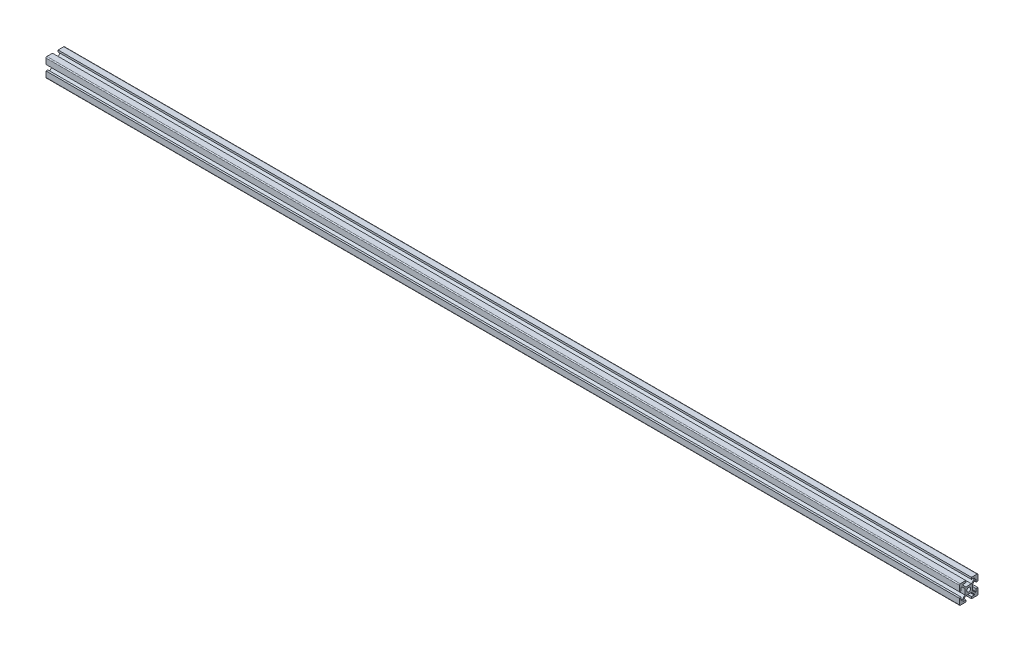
ISO-10303-21;
HEADER;
FILE_DESCRIPTION(('STEP AP214'),'2;1');
FILE_NAME('part.step','',(''),(''),'','','');
FILE_SCHEMA(('AUTOMOTIVE_DESIGN { 1 0 10303 214 1 1 1 1 }'));
ENDSEC;
DATA;
#1=APPLICATION_CONTEXT('core data for automotive mechanical design processes');
#2=APPLICATION_PROTOCOL_DEFINITION('international standard','automotive_design',2000,#1);
#3=PRODUCT_CONTEXT('',#1,'mechanical');
#4=PRODUCT('Part','Part','',(#3));
#5=PRODUCT_RELATED_PRODUCT_CATEGORY('part','',(#4));
#6=PRODUCT_DEFINITION_FORMATION('','',#4);
#7=PRODUCT_DEFINITION_CONTEXT('part definition',#1,'design');
#8=PRODUCT_DEFINITION('design','',#6,#7);
#9=PRODUCT_DEFINITION_SHAPE('','',#8);
#10=(LENGTH_UNIT() NAMED_UNIT(*) SI_UNIT(.MILLI.,.METRE.));
#11=(NAMED_UNIT(*) PLANE_ANGLE_UNIT() SI_UNIT($,.RADIAN.));
#12=(NAMED_UNIT(*) SI_UNIT($,.STERADIAN.) SOLID_ANGLE_UNIT());
#13=UNCERTAINTY_MEASURE_WITH_UNIT(LENGTH_MEASURE(1.E-05),#10,'distance_accuracy_value','');
#14=(GEOMETRIC_REPRESENTATION_CONTEXT(3) GLOBAL_UNCERTAINTY_ASSIGNED_CONTEXT((#13)) GLOBAL_UNIT_ASSIGNED_CONTEXT((#10,
#11,#12)) REPRESENTATION_CONTEXT('',''));
#15=CARTESIAN_POINT('',(0.,0.,0.));
#16=DIRECTION('',(0.,0.,1.));
#17=DIRECTION('',(1.,0.,0.));
#18=AXIS2_PLACEMENT_3D('',#15,#16,#17);
#19=CARTESIAN_POINT('',(980.,9.,9.));
#20=DIRECTION('',(1.,0.,0.));
#21=DIRECTION('',(0.,0.,-1.));
#22=AXIS2_PLACEMENT_3D('',#19,#20,#21);
#23=PLANE('',#22);
#24=CARTESIAN_POINT('',(980.,9.,9.));
#25=DIRECTION('',(1.,0.,0.));
#26=DIRECTION('',(0.,0.,-1.));
#27=AXIS2_PLACEMENT_3D('',#24,#25,#26);
#28=CIRCLE('',#27,1.);
#29=CARTESIAN_POINT('',(980.,10.,9.));
#30=VERTEX_POINT('',#29);
#31=CARTESIAN_POINT('',(980.,9.,10.));
#32=VERTEX_POINT('',#31);
#33=EDGE_CURVE('E467',#30,#32,#28,.T.);
#34=ORIENTED_EDGE('',*,*,#33,.T.);
#35=DIRECTION('',(0.,-1.,0.));
#36=VECTOR('',#35,1.);
#37=CARTESIAN_POINT('',(980.,9.,10.));
#38=LINE('',#37,#36);
#39=CARTESIAN_POINT('',(980.,3.,10.));
#40=VERTEX_POINT('',#39);
#41=EDGE_CURVE('E215',#32,#40,#38,.T.);
#42=ORIENTED_EDGE('',*,*,#41,.T.);
#43=DIRECTION('',(0.,0.,-1.));
#44=VECTOR('',#43,1.);
#45=CARTESIAN_POINT('',(980.,3.,10.));
#46=LINE('',#45,#44);
#47=CARTESIAN_POINT('',(980.,3.,8.));
#48=VERTEX_POINT('',#47);
#49=EDGE_CURVE('E602',#40,#48,#46,.T.);
#50=ORIENTED_EDGE('',*,*,#49,.T.);
#51=DIRECTION('',(0.,1.,0.));
#52=VECTOR('',#51,1.);
#53=CARTESIAN_POINT('',(980.,3.,8.));
#54=LINE('',#53,#52);
#55=CARTESIAN_POINT('',(980.,6.,8.));
#56=VERTEX_POINT('',#55);
#57=EDGE_CURVE('E621',#48,#56,#54,.T.);
#58=ORIENTED_EDGE('',*,*,#57,.T.);
#59=DIRECTION('',(0.,0.,-1.));
#60=VECTOR('',#59,1.);
#61=CARTESIAN_POINT('',(980.,6.,8.));
#62=LINE('',#61,#60);
#63=CARTESIAN_POINT('',(980.,6.,7.06066017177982));
#64=VERTEX_POINT('',#63);
#65=EDGE_CURVE('E618',#56,#64,#62,.T.);
#66=ORIENTED_EDGE('',*,*,#65,.T.);
#67=DIRECTION('',(0.,-0.707106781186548,-0.707106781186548));
#68=VECTOR('',#67,1.);
#69=CARTESIAN_POINT('',(980.,6.,7.06066017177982));
#70=LINE('',#69,#68);
#71=CARTESIAN_POINT('',(980.,2.93933982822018,4.));
#72=VERTEX_POINT('',#71);
#73=EDGE_CURVE('E620',#64,#72,#70,.T.);
#74=ORIENTED_EDGE('',*,*,#73,.T.);
#75=DIRECTION('',(0.,-1.,0.));
#76=VECTOR('',#75,1.);
#77=CARTESIAN_POINT('',(980.,2.93933982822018,4.));
#78=LINE('',#77,#76);
#79=CARTESIAN_POINT('',(980.,-2.93933982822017,4.));
#80=VERTEX_POINT('',#79);
#81=EDGE_CURVE('E623',#72,#80,#78,.T.);
#82=ORIENTED_EDGE('',*,*,#81,.T.);
#83=DIRECTION('',(0.,-0.707106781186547,0.707106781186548));
#84=VECTOR('',#83,1.);
#85=CARTESIAN_POINT('',(980.,-2.93933982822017,4.));
#86=LINE('',#85,#84);
#87=CARTESIAN_POINT('',(980.,-6.,7.06066017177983));
#88=VERTEX_POINT('',#87);
#89=EDGE_CURVE('E629',#80,#88,#86,.T.);
#90=ORIENTED_EDGE('',*,*,#89,.T.);
#91=DIRECTION('',(0.,0.,1.));
#92=VECTOR('',#91,1.);
#93=CARTESIAN_POINT('',(980.,-6.,7.06066017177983));
#94=LINE('',#93,#92);
#95=CARTESIAN_POINT('',(980.,-6.,7.99999999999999));
#96=VERTEX_POINT('',#95);
#97=EDGE_CURVE('E631',#88,#96,#94,.T.);
#98=ORIENTED_EDGE('',*,*,#97,.T.);
#99=DIRECTION('',(0.,1.,0.));
#100=VECTOR('',#99,1.);
#101=CARTESIAN_POINT('',(980.,-6.,7.99999999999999));
#102=LINE('',#101,#100);
#103=CARTESIAN_POINT('',(980.,-3.,7.99999999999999));
#104=VERTEX_POINT('',#103);
#105=EDGE_CURVE('E633',#96,#104,#102,.T.);
#106=ORIENTED_EDGE('',*,*,#105,.T.);
#107=DIRECTION('',(0.,0.,1.));
#108=VECTOR('',#107,1.);
#109=CARTESIAN_POINT('',(980.,-3.,7.99999999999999));
#110=LINE('',#109,#108);
#111=CARTESIAN_POINT('',(980.,-3.,10.));
#112=VERTEX_POINT('',#111);
#113=EDGE_CURVE('E635',#104,#112,#110,.T.);
#114=ORIENTED_EDGE('',*,*,#113,.T.);
#115=DIRECTION('',(0.,-1.,0.));
#116=VECTOR('',#115,1.);
#117=CARTESIAN_POINT('',(980.,-3.,10.));
#118=LINE('',#117,#116);
#119=CARTESIAN_POINT('',(980.,-9.,10.));
#120=VERTEX_POINT('',#119);
#121=EDGE_CURVE('E637',#112,#120,#118,.T.);
#122=ORIENTED_EDGE('',*,*,#121,.T.);
#123=CARTESIAN_POINT('',(980.,-9.,9.));
#124=DIRECTION('',(1.,0.,0.));
#125=DIRECTION('',(0.,0.,-1.));
#126=AXIS2_PLACEMENT_3D('',#123,#124,#125);
#127=CIRCLE('',#126,1.);
#128=CARTESIAN_POINT('',(980.,-10.,9.));
#129=VERTEX_POINT('',#128);
#130=EDGE_CURVE('E639',#120,#129,#127,.T.);
#131=ORIENTED_EDGE('',*,*,#130,.T.);
#132=DIRECTION('',(0.,0.,-1.));
#133=VECTOR('',#132,1.);
#134=CARTESIAN_POINT('',(980.,-10.,9.));
#135=LINE('',#134,#133);
#136=CARTESIAN_POINT('',(980.,-10.,3.));
#137=VERTEX_POINT('',#136);
#138=EDGE_CURVE('E641',#129,#137,#135,.T.);
#139=ORIENTED_EDGE('',*,*,#138,.T.);
#140=DIRECTION('',(0.,1.,0.));
#141=VECTOR('',#140,1.);
#142=CARTESIAN_POINT('',(980.,-10.,3.));
#143=LINE('',#142,#141);
#144=CARTESIAN_POINT('',(980.,-8.,3.));
#145=VERTEX_POINT('',#144);
#146=EDGE_CURVE('E643',#137,#145,#143,.T.);
#147=ORIENTED_EDGE('',*,*,#146,.T.);
#148=DIRECTION('',(0.,0.,1.));
#149=VECTOR('',#148,1.);
#150=CARTESIAN_POINT('',(980.,-8.,3.));
#151=LINE('',#150,#149);
#152=CARTESIAN_POINT('',(980.,-8.,6.));
#153=VERTEX_POINT('',#152);
#154=EDGE_CURVE('E645',#145,#153,#151,.T.);
#155=ORIENTED_EDGE('',*,*,#154,.T.);
#156=DIRECTION('',(0.,1.,0.));
#157=VECTOR('',#156,1.);
#158=CARTESIAN_POINT('',(980.,-8.,6.));
#159=LINE('',#158,#157);
#160=CARTESIAN_POINT('',(980.,-7.06066017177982,6.));
#161=VERTEX_POINT('',#160);
#162=EDGE_CURVE('E647',#153,#161,#159,.T.);
#163=ORIENTED_EDGE('',*,*,#162,.T.);
#164=DIRECTION('',(0.,0.707106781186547,-0.707106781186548));
#165=VECTOR('',#164,1.);
#166=CARTESIAN_POINT('',(980.,-7.06066017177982,6.));
#167=LINE('',#166,#165);
#168=CARTESIAN_POINT('',(980.,-4.,2.93933982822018));
#169=VERTEX_POINT('',#168);
#170=EDGE_CURVE('E649',#161,#169,#167,.T.);
#171=ORIENTED_EDGE('',*,*,#170,.T.);
#172=DIRECTION('',(0.,0.,-1.));
#173=VECTOR('',#172,1.);
#174=CARTESIAN_POINT('',(980.,-4.,2.93933982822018));
#175=LINE('',#174,#173);
#176=CARTESIAN_POINT('',(980.,-4.,-2.93933982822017));
#177=VERTEX_POINT('',#176);
#178=EDGE_CURVE('E651',#169,#177,#175,.T.);
#179=ORIENTED_EDGE('',*,*,#178,.T.);
#180=DIRECTION('',(0.,-0.707106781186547,-0.707106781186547));
#181=VECTOR('',#180,1.);
#182=CARTESIAN_POINT('',(980.,-4.,-2.93933982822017));
#183=LINE('',#182,#181);
#184=CARTESIAN_POINT('',(980.,-7.06066017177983,-6.));
#185=VERTEX_POINT('',#184);
#186=EDGE_CURVE('E653',#177,#185,#183,.T.);
#187=ORIENTED_EDGE('',*,*,#186,.T.);
#188=DIRECTION('',(0.,-1.,0.));
#189=VECTOR('',#188,1.);
#190=CARTESIAN_POINT('',(980.,-7.06066017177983,-6.));
#191=LINE('',#190,#189);
#192=CARTESIAN_POINT('',(980.,-7.99999999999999,-6.));
#193=VERTEX_POINT('',#192);
#194=EDGE_CURVE('E655',#185,#193,#191,.T.);
#195=ORIENTED_EDGE('',*,*,#194,.T.);
#196=DIRECTION('',(0.,0.,1.));
#197=VECTOR('',#196,1.);
#198=CARTESIAN_POINT('',(980.,-7.99999999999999,-6.));
#199=LINE('',#198,#197);
#200=CARTESIAN_POINT('',(980.,-7.99999999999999,-3.));
#201=VERTEX_POINT('',#200);
#202=EDGE_CURVE('E657',#193,#201,#199,.T.);
#203=ORIENTED_EDGE('',*,*,#202,.T.);
#204=DIRECTION('',(0.,-1.,0.));
#205=VECTOR('',#204,1.);
#206=CARTESIAN_POINT('',(980.,-7.99999999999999,-3.));
#207=LINE('',#206,#205);
#208=CARTESIAN_POINT('',(980.,-10.,-3.));
#209=VERTEX_POINT('',#208);
#210=EDGE_CURVE('E659',#201,#209,#207,.T.);
#211=ORIENTED_EDGE('',*,*,#210,.T.);
#212=DIRECTION('',(0.,0.,-1.));
#213=VECTOR('',#212,1.);
#214=CARTESIAN_POINT('',(980.,-10.,-3.));
#215=LINE('',#214,#213);
#216=CARTESIAN_POINT('',(980.,-10.,-9.00000000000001));
#217=VERTEX_POINT('',#216);
#218=EDGE_CURVE('E661',#209,#217,#215,.T.);
#219=ORIENTED_EDGE('',*,*,#218,.T.);
#220=CARTESIAN_POINT('',(980.,-9.,-9.00000000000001));
#221=DIRECTION('',(1.,0.,0.));
#222=DIRECTION('',(0.,0.,-1.));
#223=AXIS2_PLACEMENT_3D('',#220,#221,#222);
#224=CIRCLE('',#223,0.999999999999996);
#225=CARTESIAN_POINT('',(980.,-9.,-10.));
#226=VERTEX_POINT('',#225);
#227=EDGE_CURVE('E663',#217,#226,#224,.T.);
#228=ORIENTED_EDGE('',*,*,#227,.T.);
#229=DIRECTION('',(0.,1.,0.));
#230=VECTOR('',#229,1.);
#231=CARTESIAN_POINT('',(980.,-9.,-10.));
#232=LINE('',#231,#230);
#233=CARTESIAN_POINT('',(980.,-3.,-10.));
#234=VERTEX_POINT('',#233);
#235=EDGE_CURVE('E665',#226,#234,#232,.T.);
#236=ORIENTED_EDGE('',*,*,#235,.T.);
#237=DIRECTION('',(0.,0.,1.));
#238=VECTOR('',#237,1.);
#239=CARTESIAN_POINT('',(980.,-3.,-10.));
#240=LINE('',#239,#238);
#241=CARTESIAN_POINT('',(980.,-3.,-8.00000000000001));
#242=VERTEX_POINT('',#241);
#243=EDGE_CURVE('E667',#234,#242,#240,.T.);
#244=ORIENTED_EDGE('',*,*,#243,.T.);
#245=DIRECTION('',(0.,-1.,0.));
#246=VECTOR('',#245,1.);
#247=CARTESIAN_POINT('',(980.,-3.,-8.00000000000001));
#248=LINE('',#247,#246);
#249=CARTESIAN_POINT('',(980.,-6.,-8.00000000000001));
#250=VERTEX_POINT('',#249);
#251=EDGE_CURVE('E669',#242,#250,#248,.T.);
#252=ORIENTED_EDGE('',*,*,#251,.T.);
#253=DIRECTION('',(0.,0.,1.));
#254=VECTOR('',#253,1.);
#255=CARTESIAN_POINT('',(980.,-6.,-8.00000000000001));
#256=LINE('',#255,#254);
#257=CARTESIAN_POINT('',(980.,-6.,-7.06066017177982));
#258=VERTEX_POINT('',#257);
#259=EDGE_CURVE('E671',#250,#258,#256,.T.);
#260=ORIENTED_EDGE('',*,*,#259,.T.);
#261=DIRECTION('',(0.,0.707106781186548,0.707106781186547));
#262=VECTOR('',#261,1.);
#263=CARTESIAN_POINT('',(980.,-6.,-7.06066017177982));
#264=LINE('',#263,#262);
#265=CARTESIAN_POINT('',(980.,-2.93933982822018,-4.));
#266=VERTEX_POINT('',#265);
#267=EDGE_CURVE('E673',#258,#266,#264,.T.);
#268=ORIENTED_EDGE('',*,*,#267,.T.);
#269=DIRECTION('',(0.,1.,0.));
#270=VECTOR('',#269,1.);
#271=CARTESIAN_POINT('',(980.,-2.93933982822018,-4.));
#272=LINE('',#271,#270);
#273=CARTESIAN_POINT('',(980.,2.93933982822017,-4.));
#274=VERTEX_POINT('',#273);
#275=EDGE_CURVE('E675',#266,#274,#272,.T.);
#276=ORIENTED_EDGE('',*,*,#275,.T.);
#277=DIRECTION('',(0.,0.707106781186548,-0.707106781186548));
#278=VECTOR('',#277,1.);
#279=CARTESIAN_POINT('',(980.,2.93933982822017,-4.));
#280=LINE('',#279,#278);
#281=CARTESIAN_POINT('',(980.,6.,-7.06066017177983));
#282=VERTEX_POINT('',#281);
#283=EDGE_CURVE('E677',#274,#282,#280,.T.);
#284=ORIENTED_EDGE('',*,*,#283,.T.);
#285=DIRECTION('',(0.,0.,-1.));
#286=VECTOR('',#285,1.);
#287=CARTESIAN_POINT('',(980.,6.,-7.06066017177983));
#288=LINE('',#287,#286);
#289=CARTESIAN_POINT('',(980.,6.,-7.99999999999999));
#290=VERTEX_POINT('',#289);
#291=EDGE_CURVE('E679',#282,#290,#288,.T.);
#292=ORIENTED_EDGE('',*,*,#291,.T.);
#293=DIRECTION('',(0.,-1.,0.));
#294=VECTOR('',#293,1.);
#295=CARTESIAN_POINT('',(980.,6.,-7.99999999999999));
#296=LINE('',#295,#294);
#297=CARTESIAN_POINT('',(980.,3.,-7.99999999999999));
#298=VERTEX_POINT('',#297);
#299=EDGE_CURVE('E681',#290,#298,#296,.T.);
#300=ORIENTED_EDGE('',*,*,#299,.T.);
#301=DIRECTION('',(0.,0.,-1.));
#302=VECTOR('',#301,1.);
#303=CARTESIAN_POINT('',(980.,3.,-7.99999999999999));
#304=LINE('',#303,#302);
#305=CARTESIAN_POINT('',(980.,3.,-10.));
#306=VERTEX_POINT('',#305);
#307=EDGE_CURVE('E683',#298,#306,#304,.T.);
#308=ORIENTED_EDGE('',*,*,#307,.T.);
#309=DIRECTION('',(0.,1.,0.));
#310=VECTOR('',#309,1.);
#311=CARTESIAN_POINT('',(980.,3.,-10.));
#312=LINE('',#311,#310);
#313=CARTESIAN_POINT('',(980.,9.,-10.));
#314=VERTEX_POINT('',#313);
#315=EDGE_CURVE('E685',#306,#314,#312,.T.);
#316=ORIENTED_EDGE('',*,*,#315,.T.);
#317=CARTESIAN_POINT('',(980.,9.,-9.00000000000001));
#318=DIRECTION('',(1.,0.,0.));
#319=DIRECTION('',(0.,0.,-1.));
#320=AXIS2_PLACEMENT_3D('',#317,#318,#319);
#321=CIRCLE('',#320,1.);
#322=CARTESIAN_POINT('',(980.,10.,-9.00000000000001));
#323=VERTEX_POINT('',#322);
#324=EDGE_CURVE('E687',#314,#323,#321,.T.);
#325=ORIENTED_EDGE('',*,*,#324,.T.);
#326=DIRECTION('',(0.,0.,1.));
#327=VECTOR('',#326,1.);
#328=CARTESIAN_POINT('',(980.,10.,-9.00000000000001));
#329=LINE('',#328,#327);
#330=CARTESIAN_POINT('',(980.,10.,-3.));
#331=VERTEX_POINT('',#330);
#332=EDGE_CURVE('E689',#323,#331,#329,.T.);
#333=ORIENTED_EDGE('',*,*,#332,.T.);
#334=DIRECTION('',(0.,-1.,0.));
#335=VECTOR('',#334,1.);
#336=CARTESIAN_POINT('',(980.,10.,-3.));
#337=LINE('',#336,#335);
#338=CARTESIAN_POINT('',(980.,8.,-3.));
#339=VERTEX_POINT('',#338);
#340=EDGE_CURVE('E691',#331,#339,#337,.T.);
#341=ORIENTED_EDGE('',*,*,#340,.T.);
#342=DIRECTION('',(0.,0.,-1.));
#343=VECTOR('',#342,1.);
#344=CARTESIAN_POINT('',(980.,8.,-3.));
#345=LINE('',#344,#343);
#346=CARTESIAN_POINT('',(980.,8.,-6.));
#347=VERTEX_POINT('',#346);
#348=EDGE_CURVE('E693',#339,#347,#345,.T.);
#349=ORIENTED_EDGE('',*,*,#348,.T.);
#350=DIRECTION('',(0.,-1.,0.));
#351=VECTOR('',#350,1.);
#352=CARTESIAN_POINT('',(980.,8.,-6.));
#353=LINE('',#352,#351);
#354=CARTESIAN_POINT('',(980.,7.06066017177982,-6.));
#355=VERTEX_POINT('',#354);
#356=EDGE_CURVE('E695',#347,#355,#353,.T.);
#357=ORIENTED_EDGE('',*,*,#356,.T.);
#358=DIRECTION('',(0.,-0.707106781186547,0.707106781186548));
#359=VECTOR('',#358,1.);
#360=CARTESIAN_POINT('',(980.,7.06066017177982,-6.));
#361=LINE('',#360,#359);
#362=CARTESIAN_POINT('',(980.,4.,-2.93933982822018));
#363=VERTEX_POINT('',#362);
#364=EDGE_CURVE('E697',#355,#363,#361,.T.);
#365=ORIENTED_EDGE('',*,*,#364,.T.);
#366=DIRECTION('',(0.,0.,1.));
#367=VECTOR('',#366,1.);
#368=CARTESIAN_POINT('',(980.,4.,-2.93933982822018));
#369=LINE('',#368,#367);
#370=CARTESIAN_POINT('',(980.,4.,2.93933982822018));
#371=VERTEX_POINT('',#370);
#372=EDGE_CURVE('E699',#363,#371,#369,.T.);
#373=ORIENTED_EDGE('',*,*,#372,.T.);
#374=DIRECTION('',(0.,0.707106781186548,0.707106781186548));
#375=VECTOR('',#374,1.);
#376=CARTESIAN_POINT('',(980.,4.,2.93933982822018));
#377=LINE('',#376,#375);
#378=CARTESIAN_POINT('',(980.,7.06066017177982,6.));
#379=VERTEX_POINT('',#378);
#380=EDGE_CURVE('E701',#371,#379,#377,.T.);
#381=ORIENTED_EDGE('',*,*,#380,.T.);
#382=DIRECTION('',(0.,1.,0.));
#383=VECTOR('',#382,1.);
#384=CARTESIAN_POINT('',(980.,7.06066017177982,6.));
#385=LINE('',#384,#383);
#386=CARTESIAN_POINT('',(980.,7.99999999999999,6.));
#387=VERTEX_POINT('',#386);
#388=EDGE_CURVE('E354',#379,#387,#385,.T.);
#389=ORIENTED_EDGE('',*,*,#388,.T.);
#390=DIRECTION('',(0.,0.,-1.));
#391=VECTOR('',#390,1.);
#392=CARTESIAN_POINT('',(980.,7.99999999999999,6.));
#393=LINE('',#392,#391);
#394=CARTESIAN_POINT('',(980.,7.99999999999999,3.));
#395=VERTEX_POINT('',#394);
#396=EDGE_CURVE('E348',#387,#395,#393,.T.);
#397=ORIENTED_EDGE('',*,*,#396,.T.);
#398=DIRECTION('',(0.,1.,0.));
#399=VECTOR('',#398,1.);
#400=CARTESIAN_POINT('',(980.,7.99999999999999,3.));
#401=LINE('',#400,#399);
#402=CARTESIAN_POINT('',(980.,10.,3.));
#403=VERTEX_POINT('',#402);
#404=EDGE_CURVE('E352',#395,#403,#401,.T.);
#405=ORIENTED_EDGE('',*,*,#404,.T.);
#406=DIRECTION('',(0.,0.,1.));
#407=VECTOR('',#406,1.);
#408=CARTESIAN_POINT('',(980.,10.,3.));
#409=LINE('',#408,#407);
#410=EDGE_CURVE('E52',#403,#30,#409,.T.);
#411=ORIENTED_EDGE('',*,*,#410,.T.);
#412=EDGE_LOOP('',(#34,#42,#50,#58,#66,#74,#82,#90,#98,#106,#114,#122,#131,#139,#147,#155,#163,
#171,#179,#187,#195,#203,#211,#219,#228,#236,#244,#252,#260,#268,#276,#284,#292,#300,#308,#316,
#325,#333,#341,#349,#357,#365,#373,#381,#389,#397,#405,#411));
#413=FACE_BOUND('',#412,.T.);
#414=CARTESIAN_POINT('',(980.,0.,0.));
#415=DIRECTION('',(1.,0.,0.));
#416=DIRECTION('',(0.,0.,-1.));
#417=AXIS2_PLACEMENT_3D('',#414,#415,#416);
#418=CIRCLE('',#417,2.1);
#419=CARTESIAN_POINT('',(980.,0.,-2.1));
#420=VERTEX_POINT('',#419);
#421=EDGE_CURVE('E376',#420,#420,#418,.T.);
#422=ORIENTED_EDGE('',*,*,#421,.F.);
#423=EDGE_LOOP('',(#422));
#424=FACE_BOUND('',#423,.T.);
#425=ADVANCED_FACE('F35',(#413,#424),#23,.T.);
#426=CARTESIAN_POINT('',(0.,9.,9.));
#427=DIRECTION('',(1.,0.,0.));
#428=DIRECTION('',(0.,0.,-1.));
#429=AXIS2_PLACEMENT_3D('',#426,#427,#428);
#430=PLANE('',#429);
#431=CARTESIAN_POINT('',(0.,9.,9.));
#432=DIRECTION('',(1.,0.,0.));
#433=DIRECTION('',(0.,0.,-1.));
#434=AXIS2_PLACEMENT_3D('',#431,#432,#433);
#435=CIRCLE('',#434,1.);
#436=CARTESIAN_POINT('',(0.,10.,9.));
#437=VERTEX_POINT('',#436);
#438=CARTESIAN_POINT('',(0.,9.,10.));
#439=VERTEX_POINT('',#438);
#440=EDGE_CURVE('E372',#437,#439,#435,.T.);
#441=ORIENTED_EDGE('',*,*,#440,.F.);
#442=DIRECTION('',(0.,0.,1.));
#443=VECTOR('',#442,1.);
#444=CARTESIAN_POINT('',(0.,10.,3.));
#445=LINE('',#444,#443);
#446=CARTESIAN_POINT('',(0.,10.,3.));
#447=VERTEX_POINT('',#446);
#448=EDGE_CURVE('E207',#447,#437,#445,.T.);
#449=ORIENTED_EDGE('',*,*,#448,.F.);
#450=DIRECTION('',(0.,1.,0.));
#451=VECTOR('',#450,1.);
#452=CARTESIAN_POINT('',(0.,7.99999999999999,3.));
#453=LINE('',#452,#451);
#454=CARTESIAN_POINT('',(0.,7.99999999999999,3.));
#455=VERTEX_POINT('',#454);
#456=EDGE_CURVE('E201',#455,#447,#453,.T.);
#457=ORIENTED_EDGE('',*,*,#456,.F.);
#458=DIRECTION('',(0.,0.,-1.));
#459=VECTOR('',#458,1.);
#460=CARTESIAN_POINT('',(0.,7.99999999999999,6.));
#461=LINE('',#460,#459);
#462=CARTESIAN_POINT('',(0.,7.99999999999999,6.));
#463=VERTEX_POINT('',#462);
#464=EDGE_CURVE('E362',#463,#455,#461,.T.);
#465=ORIENTED_EDGE('',*,*,#464,.F.);
#466=DIRECTION('',(0.,1.,0.));
#467=VECTOR('',#466,1.);
#468=CARTESIAN_POINT('',(0.,7.06066017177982,6.));
#469=LINE('',#468,#467);
#470=CARTESIAN_POINT('',(0.,7.06066017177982,6.));
#471=VERTEX_POINT('',#470);
#472=EDGE_CURVE('E462',#471,#463,#469,.T.);
#473=ORIENTED_EDGE('',*,*,#472,.F.);
#474=DIRECTION('',(0.,0.707106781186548,0.707106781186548));
#475=VECTOR('',#474,1.);
#476=CARTESIAN_POINT('',(0.,4.,2.93933982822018));
#477=LINE('',#476,#475);
#478=CARTESIAN_POINT('',(0.,4.,2.93933982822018));
#479=VERTEX_POINT('',#478);
#480=EDGE_CURVE('E460',#479,#471,#477,.T.);
#481=ORIENTED_EDGE('',*,*,#480,.F.);
#482=DIRECTION('',(0.,0.,1.));
#483=VECTOR('',#482,1.);
#484=CARTESIAN_POINT('',(0.,4.,-2.93933982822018));
#485=LINE('',#484,#483);
#486=CARTESIAN_POINT('',(0.,4.,-2.93933982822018));
#487=VERTEX_POINT('',#486);
#488=EDGE_CURVE('E458',#487,#479,#485,.T.);
#489=ORIENTED_EDGE('',*,*,#488,.F.);
#490=DIRECTION('',(0.,-0.707106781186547,0.707106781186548));
#491=VECTOR('',#490,1.);
#492=CARTESIAN_POINT('',(0.,7.06066017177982,-6.));
#493=LINE('',#492,#491);
#494=CARTESIAN_POINT('',(0.,7.06066017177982,-6.));
#495=VERTEX_POINT('',#494);
#496=EDGE_CURVE('E456',#495,#487,#493,.T.);
#497=ORIENTED_EDGE('',*,*,#496,.F.);
#498=DIRECTION('',(0.,-1.,0.));
#499=VECTOR('',#498,1.);
#500=CARTESIAN_POINT('',(0.,8.,-6.));
#501=LINE('',#500,#499);
#502=CARTESIAN_POINT('',(0.,8.,-6.));
#503=VERTEX_POINT('',#502);
#504=EDGE_CURVE('E454',#503,#495,#501,.T.);
#505=ORIENTED_EDGE('',*,*,#504,.F.);
#506=DIRECTION('',(0.,0.,-1.));
#507=VECTOR('',#506,1.);
#508=CARTESIAN_POINT('',(0.,8.,-3.));
#509=LINE('',#508,#507);
#510=CARTESIAN_POINT('',(0.,8.,-3.));
#511=VERTEX_POINT('',#510);
#512=EDGE_CURVE('E452',#511,#503,#509,.T.);
#513=ORIENTED_EDGE('',*,*,#512,.F.);
#514=DIRECTION('',(0.,-1.,0.));
#515=VECTOR('',#514,1.);
#516=CARTESIAN_POINT('',(0.,10.,-3.));
#517=LINE('',#516,#515);
#518=CARTESIAN_POINT('',(0.,10.,-3.));
#519=VERTEX_POINT('',#518);
#520=EDGE_CURVE('E450',#519,#511,#517,.T.);
#521=ORIENTED_EDGE('',*,*,#520,.F.);
#522=DIRECTION('',(0.,0.,1.));
#523=VECTOR('',#522,1.);
#524=CARTESIAN_POINT('',(0.,10.,-9.00000000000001));
#525=LINE('',#524,#523);
#526=CARTESIAN_POINT('',(0.,10.,-9.00000000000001));
#527=VERTEX_POINT('',#526);
#528=EDGE_CURVE('E448',#527,#519,#525,.T.);
#529=ORIENTED_EDGE('',*,*,#528,.F.);
#530=CARTESIAN_POINT('',(0.,9.,-9.00000000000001));
#531=DIRECTION('',(1.,0.,0.));
#532=DIRECTION('',(0.,0.,-1.));
#533=AXIS2_PLACEMENT_3D('',#530,#531,#532);
#534=CIRCLE('',#533,1.);
#535=CARTESIAN_POINT('',(0.,9.,-10.));
#536=VERTEX_POINT('',#535);
#537=EDGE_CURVE('E446',#536,#527,#534,.T.);
#538=ORIENTED_EDGE('',*,*,#537,.F.);
#539=DIRECTION('',(0.,1.,0.));
#540=VECTOR('',#539,1.);
#541=CARTESIAN_POINT('',(0.,3.,-10.));
#542=LINE('',#541,#540);
#543=CARTESIAN_POINT('',(0.,3.,-10.));
#544=VERTEX_POINT('',#543);
#545=EDGE_CURVE('E444',#544,#536,#542,.T.);
#546=ORIENTED_EDGE('',*,*,#545,.F.);
#547=DIRECTION('',(0.,0.,-1.));
#548=VECTOR('',#547,1.);
#549=CARTESIAN_POINT('',(0.,3.,-7.99999999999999));
#550=LINE('',#549,#548);
#551=CARTESIAN_POINT('',(0.,3.,-7.99999999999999));
#552=VERTEX_POINT('',#551);
#553=EDGE_CURVE('E442',#552,#544,#550,.T.);
#554=ORIENTED_EDGE('',*,*,#553,.F.);
#555=DIRECTION('',(0.,-1.,0.));
#556=VECTOR('',#555,1.);
#557=CARTESIAN_POINT('',(0.,6.,-7.99999999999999));
#558=LINE('',#557,#556);
#559=CARTESIAN_POINT('',(0.,6.,-7.99999999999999));
#560=VERTEX_POINT('',#559);
#561=EDGE_CURVE('E440',#560,#552,#558,.T.);
#562=ORIENTED_EDGE('',*,*,#561,.F.);
#563=DIRECTION('',(0.,0.,-1.));
#564=VECTOR('',#563,1.);
#565=CARTESIAN_POINT('',(0.,6.,-7.06066017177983));
#566=LINE('',#565,#564);
#567=CARTESIAN_POINT('',(0.,6.,-7.06066017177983));
#568=VERTEX_POINT('',#567);
#569=EDGE_CURVE('E438',#568,#560,#566,.T.);
#570=ORIENTED_EDGE('',*,*,#569,.F.);
#571=DIRECTION('',(0.,0.707106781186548,-0.707106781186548));
#572=VECTOR('',#571,1.);
#573=CARTESIAN_POINT('',(0.,2.93933982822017,-4.));
#574=LINE('',#573,#572);
#575=CARTESIAN_POINT('',(0.,2.93933982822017,-4.));
#576=VERTEX_POINT('',#575);
#577=EDGE_CURVE('E436',#576,#568,#574,.T.);
#578=ORIENTED_EDGE('',*,*,#577,.F.);
#579=DIRECTION('',(0.,1.,0.));
#580=VECTOR('',#579,1.);
#581=CARTESIAN_POINT('',(0.,-2.93933982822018,-4.));
#582=LINE('',#581,#580);
#583=CARTESIAN_POINT('',(0.,-2.93933982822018,-4.));
#584=VERTEX_POINT('',#583);
#585=EDGE_CURVE('E434',#584,#576,#582,.T.);
#586=ORIENTED_EDGE('',*,*,#585,.F.);
#587=DIRECTION('',(0.,0.707106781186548,0.707106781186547));
#588=VECTOR('',#587,1.);
#589=CARTESIAN_POINT('',(0.,-6.,-7.06066017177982));
#590=LINE('',#589,#588);
#591=CARTESIAN_POINT('',(0.,-6.,-7.06066017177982));
#592=VERTEX_POINT('',#591);
#593=EDGE_CURVE('E432',#592,#584,#590,.T.);
#594=ORIENTED_EDGE('',*,*,#593,.F.);
#595=DIRECTION('',(0.,0.,1.));
#596=VECTOR('',#595,1.);
#597=CARTESIAN_POINT('',(0.,-6.,-8.00000000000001));
#598=LINE('',#597,#596);
#599=CARTESIAN_POINT('',(0.,-6.,-8.00000000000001));
#600=VERTEX_POINT('',#599);
#601=EDGE_CURVE('E430',#600,#592,#598,.T.);
#602=ORIENTED_EDGE('',*,*,#601,.F.);
#603=DIRECTION('',(0.,-1.,0.));
#604=VECTOR('',#603,1.);
#605=CARTESIAN_POINT('',(0.,-3.,-8.00000000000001));
#606=LINE('',#605,#604);
#607=CARTESIAN_POINT('',(0.,-3.,-8.00000000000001));
#608=VERTEX_POINT('',#607);
#609=EDGE_CURVE('E428',#608,#600,#606,.T.);
#610=ORIENTED_EDGE('',*,*,#609,.F.);
#611=DIRECTION('',(0.,0.,1.));
#612=VECTOR('',#611,1.);
#613=CARTESIAN_POINT('',(0.,-3.,-10.));
#614=LINE('',#613,#612);
#615=CARTESIAN_POINT('',(0.,-3.,-10.));
#616=VERTEX_POINT('',#615);
#617=EDGE_CURVE('E426',#616,#608,#614,.T.);
#618=ORIENTED_EDGE('',*,*,#617,.F.);
#619=DIRECTION('',(0.,1.,0.));
#620=VECTOR('',#619,1.);
#621=CARTESIAN_POINT('',(0.,-9.,-10.));
#622=LINE('',#621,#620);
#623=CARTESIAN_POINT('',(0.,-9.,-10.));
#624=VERTEX_POINT('',#623);
#625=EDGE_CURVE('E424',#624,#616,#622,.T.);
#626=ORIENTED_EDGE('',*,*,#625,.F.);
#627=CARTESIAN_POINT('',(0.,-9.,-9.00000000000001));
#628=DIRECTION('',(1.,0.,0.));
#629=DIRECTION('',(0.,0.,-1.));
#630=AXIS2_PLACEMENT_3D('',#627,#628,#629);
#631=CIRCLE('',#630,0.999999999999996);
#632=CARTESIAN_POINT('',(0.,-10.,-9.00000000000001));
#633=VERTEX_POINT('',#632);
#634=EDGE_CURVE('E422',#633,#624,#631,.T.);
#635=ORIENTED_EDGE('',*,*,#634,.F.);
#636=DIRECTION('',(0.,0.,-1.));
#637=VECTOR('',#636,1.);
#638=CARTESIAN_POINT('',(0.,-10.,-3.));
#639=LINE('',#638,#637);
#640=CARTESIAN_POINT('',(0.,-10.,-3.));
#641=VERTEX_POINT('',#640);
#642=EDGE_CURVE('E420',#641,#633,#639,.T.);
#643=ORIENTED_EDGE('',*,*,#642,.F.);
#644=DIRECTION('',(0.,-1.,0.));
#645=VECTOR('',#644,1.);
#646=CARTESIAN_POINT('',(0.,-7.99999999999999,-3.));
#647=LINE('',#646,#645);
#648=CARTESIAN_POINT('',(0.,-7.99999999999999,-3.));
#649=VERTEX_POINT('',#648);
#650=EDGE_CURVE('E418',#649,#641,#647,.T.);
#651=ORIENTED_EDGE('',*,*,#650,.F.);
#652=DIRECTION('',(0.,0.,1.));
#653=VECTOR('',#652,1.);
#654=CARTESIAN_POINT('',(0.,-7.99999999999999,-6.));
#655=LINE('',#654,#653);
#656=CARTESIAN_POINT('',(0.,-7.99999999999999,-6.));
#657=VERTEX_POINT('',#656);
#658=EDGE_CURVE('E416',#657,#649,#655,.T.);
#659=ORIENTED_EDGE('',*,*,#658,.F.);
#660=DIRECTION('',(0.,-1.,0.));
#661=VECTOR('',#660,1.);
#662=CARTESIAN_POINT('',(0.,-7.06066017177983,-6.));
#663=LINE('',#662,#661);
#664=CARTESIAN_POINT('',(0.,-7.06066017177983,-6.));
#665=VERTEX_POINT('',#664);
#666=EDGE_CURVE('E414',#665,#657,#663,.T.);
#667=ORIENTED_EDGE('',*,*,#666,.F.);
#668=DIRECTION('',(0.,-0.707106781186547,-0.707106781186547));
#669=VECTOR('',#668,1.);
#670=CARTESIAN_POINT('',(0.,-4.,-2.93933982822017));
#671=LINE('',#670,#669);
#672=CARTESIAN_POINT('',(0.,-4.,-2.93933982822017));
#673=VERTEX_POINT('',#672);
#674=EDGE_CURVE('E412',#673,#665,#671,.T.);
#675=ORIENTED_EDGE('',*,*,#674,.F.);
#676=DIRECTION('',(0.,0.,-1.));
#677=VECTOR('',#676,1.);
#678=CARTESIAN_POINT('',(0.,-4.,2.93933982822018));
#679=LINE('',#678,#677);
#680=CARTESIAN_POINT('',(0.,-4.,2.93933982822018));
#681=VERTEX_POINT('',#680);
#682=EDGE_CURVE('E410',#681,#673,#679,.T.);
#683=ORIENTED_EDGE('',*,*,#682,.F.);
#684=DIRECTION('',(0.,0.707106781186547,-0.707106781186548));
#685=VECTOR('',#684,1.);
#686=CARTESIAN_POINT('',(0.,-7.06066017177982,6.));
#687=LINE('',#686,#685);
#688=CARTESIAN_POINT('',(0.,-7.06066017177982,6.));
#689=VERTEX_POINT('',#688);
#690=EDGE_CURVE('E408',#689,#681,#687,.T.);
#691=ORIENTED_EDGE('',*,*,#690,.F.);
#692=DIRECTION('',(0.,1.,0.));
#693=VECTOR('',#692,1.);
#694=CARTESIAN_POINT('',(0.,-8.,6.));
#695=LINE('',#694,#693);
#696=CARTESIAN_POINT('',(0.,-8.,6.));
#697=VERTEX_POINT('',#696);
#698=EDGE_CURVE('E406',#697,#689,#695,.T.);
#699=ORIENTED_EDGE('',*,*,#698,.F.);
#700=DIRECTION('',(0.,0.,1.));
#701=VECTOR('',#700,1.);
#702=CARTESIAN_POINT('',(0.,-8.,3.));
#703=LINE('',#702,#701);
#704=CARTESIAN_POINT('',(0.,-8.,3.));
#705=VERTEX_POINT('',#704);
#706=EDGE_CURVE('E404',#705,#697,#703,.T.);
#707=ORIENTED_EDGE('',*,*,#706,.F.);
#708=DIRECTION('',(0.,1.,0.));
#709=VECTOR('',#708,1.);
#710=CARTESIAN_POINT('',(0.,-10.,3.));
#711=LINE('',#710,#709);
#712=CARTESIAN_POINT('',(0.,-10.,3.));
#713=VERTEX_POINT('',#712);
#714=EDGE_CURVE('E402',#713,#705,#711,.T.);
#715=ORIENTED_EDGE('',*,*,#714,.F.);
#716=DIRECTION('',(0.,0.,-1.));
#717=VECTOR('',#716,1.);
#718=CARTESIAN_POINT('',(0.,-10.,9.));
#719=LINE('',#718,#717);
#720=CARTESIAN_POINT('',(0.,-10.,9.));
#721=VERTEX_POINT('',#720);
#722=EDGE_CURVE('E400',#721,#713,#719,.T.);
#723=ORIENTED_EDGE('',*,*,#722,.F.);
#724=CARTESIAN_POINT('',(0.,-9.,9.));
#725=DIRECTION('',(1.,0.,0.));
#726=DIRECTION('',(0.,0.,-1.));
#727=AXIS2_PLACEMENT_3D('',#724,#725,#726);
#728=CIRCLE('',#727,1.);
#729=CARTESIAN_POINT('',(0.,-9.,10.));
#730=VERTEX_POINT('',#729);
#731=EDGE_CURVE('E398',#730,#721,#728,.T.);
#732=ORIENTED_EDGE('',*,*,#731,.F.);
#733=DIRECTION('',(0.,-1.,0.));
#734=VECTOR('',#733,1.);
#735=CARTESIAN_POINT('',(0.,-3.,10.));
#736=LINE('',#735,#734);
#737=CARTESIAN_POINT('',(0.,-3.,10.));
#738=VERTEX_POINT('',#737);
#739=EDGE_CURVE('E396',#738,#730,#736,.T.);
#740=ORIENTED_EDGE('',*,*,#739,.F.);
#741=DIRECTION('',(0.,0.,1.));
#742=VECTOR('',#741,1.);
#743=CARTESIAN_POINT('',(0.,-3.,7.99999999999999));
#744=LINE('',#743,#742);
#745=CARTESIAN_POINT('',(0.,-3.,7.99999999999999));
#746=VERTEX_POINT('',#745);
#747=EDGE_CURVE('E394',#746,#738,#744,.T.);
#748=ORIENTED_EDGE('',*,*,#747,.F.);
#749=DIRECTION('',(0.,1.,0.));
#750=VECTOR('',#749,1.);
#751=CARTESIAN_POINT('',(0.,-6.,7.99999999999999));
#752=LINE('',#751,#750);
#753=CARTESIAN_POINT('',(0.,-6.,7.99999999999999));
#754=VERTEX_POINT('',#753);
#755=EDGE_CURVE('E392',#754,#746,#752,.T.);
#756=ORIENTED_EDGE('',*,*,#755,.F.);
#757=DIRECTION('',(0.,0.,1.));
#758=VECTOR('',#757,1.);
#759=CARTESIAN_POINT('',(0.,-6.,7.06066017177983));
#760=LINE('',#759,#758);
#761=CARTESIAN_POINT('',(0.,-6.,7.06066017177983));
#762=VERTEX_POINT('',#761);
#763=EDGE_CURVE('E390',#762,#754,#760,.T.);
#764=ORIENTED_EDGE('',*,*,#763,.F.);
#765=DIRECTION('',(0.,-0.707106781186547,0.707106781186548));
#766=VECTOR('',#765,1.);
#767=CARTESIAN_POINT('',(0.,-2.93933982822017,4.));
#768=LINE('',#767,#766);
#769=CARTESIAN_POINT('',(0.,-2.93933982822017,4.));
#770=VERTEX_POINT('',#769);
#771=EDGE_CURVE('E388',#770,#762,#768,.T.);
#772=ORIENTED_EDGE('',*,*,#771,.F.);
#773=DIRECTION('',(0.,-1.,0.));
#774=VECTOR('',#773,1.);
#775=CARTESIAN_POINT('',(0.,2.93933982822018,4.));
#776=LINE('',#775,#774);
#777=CARTESIAN_POINT('',(0.,2.93933982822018,4.));
#778=VERTEX_POINT('',#777);
#779=EDGE_CURVE('E386',#778,#770,#776,.T.);
#780=ORIENTED_EDGE('',*,*,#779,.F.);
#781=DIRECTION('',(0.,-0.707106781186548,-0.707106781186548));
#782=VECTOR('',#781,1.);
#783=CARTESIAN_POINT('',(0.,6.,7.06066017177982));
#784=LINE('',#783,#782);
#785=CARTESIAN_POINT('',(0.,6.,7.06066017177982));
#786=VERTEX_POINT('',#785);
#787=EDGE_CURVE('E384',#786,#778,#784,.T.);
#788=ORIENTED_EDGE('',*,*,#787,.F.);
#789=DIRECTION('',(0.,0.,-1.));
#790=VECTOR('',#789,1.);
#791=CARTESIAN_POINT('',(0.,6.,8.));
#792=LINE('',#791,#790);
#793=CARTESIAN_POINT('',(0.,6.,8.));
#794=VERTEX_POINT('',#793);
#795=EDGE_CURVE('E382',#794,#786,#792,.T.);
#796=ORIENTED_EDGE('',*,*,#795,.F.);
#797=DIRECTION('',(0.,1.,0.));
#798=VECTOR('',#797,1.);
#799=CARTESIAN_POINT('',(0.,3.,8.));
#800=LINE('',#799,#798);
#801=CARTESIAN_POINT('',(0.,3.,8.));
#802=VERTEX_POINT('',#801);
#803=EDGE_CURVE('E380',#802,#794,#800,.T.);
#804=ORIENTED_EDGE('',*,*,#803,.F.);
#805=DIRECTION('',(0.,0.,-1.));
#806=VECTOR('',#805,1.);
#807=CARTESIAN_POINT('',(0.,3.,10.));
#808=LINE('',#807,#806);
#809=CARTESIAN_POINT('',(0.,3.,10.));
#810=VERTEX_POINT('',#809);
#811=EDGE_CURVE('E378',#810,#802,#808,.T.);
#812=ORIENTED_EDGE('',*,*,#811,.F.);
#813=DIRECTION('',(0.,-1.,0.));
#814=VECTOR('',#813,1.);
#815=CARTESIAN_POINT('',(0.,9.,10.));
#816=LINE('',#815,#814);
#817=EDGE_CURVE('E375',#439,#810,#816,.T.);
#818=ORIENTED_EDGE('',*,*,#817,.F.);
#819=EDGE_LOOP('',(#441,#449,#457,#465,#473,#481,#489,#497,#505,#513,#521,#529,#538,#546,#554,
#562,#570,#578,#586,#594,#602,#610,#618,#626,#635,#643,#651,#659,#667,#675,#683,#691,#699,#707,
#715,#723,#732,#740,#748,#756,#764,#772,#780,#788,#796,#804,#812,#818));
#820=FACE_BOUND('',#819,.T.);
#821=CARTESIAN_POINT('',(0.,0.,0.));
#822=DIRECTION('',(1.,0.,0.));
#823=DIRECTION('',(0.,0.,-1.));
#824=AXIS2_PLACEMENT_3D('',#821,#822,#823);
#825=CIRCLE('',#824,2.1);
#826=CARTESIAN_POINT('',(0.,0.,-2.1));
#827=VERTEX_POINT('',#826);
#828=EDGE_CURVE('E1328',#827,#827,#825,.T.);
#829=ORIENTED_EDGE('',*,*,#828,.T.);
#830=EDGE_LOOP('',(#829));
#831=FACE_BOUND('',#830,.T.);
#832=ADVANCED_FACE('F606',(#820,#831),#430,.F.);
#833=CARTESIAN_POINT('',(980.,9.,9.));
#834=DIRECTION('',(-1.,0.,0.));
#835=DIRECTION('',(0.,0.,1.));
#836=AXIS2_PLACEMENT_3D('',#833,#834,#835);
#837=CYLINDRICAL_SURFACE('',#836,1.);
#838=ORIENTED_EDGE('',*,*,#440,.T.);
#839=DIRECTION('',(-1.,0.,0.));
#840=VECTOR('',#839,1.);
#841=CARTESIAN_POINT('',(980.,9.,10.));
#842=LINE('',#841,#840);
#843=EDGE_CURVE('E11',#32,#439,#842,.T.);
#844=ORIENTED_EDGE('',*,*,#843,.F.);
#845=ORIENTED_EDGE('',*,*,#33,.F.);
#846=DIRECTION('',(-1.,0.,0.));
#847=VECTOR('',#846,1.);
#848=CARTESIAN_POINT('',(980.,10.,9.));
#849=LINE('',#848,#847);
#850=EDGE_CURVE('E368',#30,#437,#849,.T.);
#851=ORIENTED_EDGE('',*,*,#850,.T.);
#852=EDGE_LOOP('',(#838,#844,#845,#851));
#853=FACE_BOUND('',#852,.T.);
#854=ADVANCED_FACE('F37',(#853),#837,.T.);
#855=CARTESIAN_POINT('',(980.,9.,10.));
#856=DIRECTION('',(0.,0.,-1.));
#857=DIRECTION('',(-1.,0.,0.));
#858=AXIS2_PLACEMENT_3D('',#855,#856,#857);
#859=PLANE('',#858);
#860=ORIENTED_EDGE('',*,*,#817,.T.);
#861=DIRECTION('',(-1.,0.,0.));
#862=VECTOR('',#861,1.);
#863=CARTESIAN_POINT('',(980.,3.,10.));
#864=LINE('',#863,#862);
#865=EDGE_CURVE('E44',#40,#810,#864,.T.);
#866=ORIENTED_EDGE('',*,*,#865,.F.);
#867=ORIENTED_EDGE('',*,*,#41,.F.);
#868=ORIENTED_EDGE('',*,*,#843,.T.);
#869=EDGE_LOOP('',(#860,#866,#867,#868));
#870=FACE_BOUND('',#869,.T.);
#871=ADVANCED_FACE('F735',(#870),#859,.F.);
#872=CARTESIAN_POINT('',(980.,3.,10.));
#873=DIRECTION('',(0.,1.,0.));
#874=DIRECTION('',(0.,0.,1.));
#875=AXIS2_PLACEMENT_3D('',#872,#873,#874);
#876=PLANE('',#875);
#877=ORIENTED_EDGE('',*,*,#811,.T.);
#878=DIRECTION('',(-1.,0.,0.));
#879=VECTOR('',#878,1.);
#880=CARTESIAN_POINT('',(980.,3.,8.));
#881=LINE('',#880,#879);
#882=EDGE_CURVE('E594',#48,#802,#881,.T.);
#883=ORIENTED_EDGE('',*,*,#882,.F.);
#884=ORIENTED_EDGE('',*,*,#49,.F.);
#885=ORIENTED_EDGE('',*,*,#865,.T.);
#886=EDGE_LOOP('',(#877,#883,#884,#885));
#887=FACE_BOUND('',#886,.T.);
#888=ADVANCED_FACE('F600',(#887),#876,.F.);
#889=CARTESIAN_POINT('',(980.,3.,8.));
#890=DIRECTION('',(0.,0.,1.));
#891=DIRECTION('',(1.,0.,0.));
#892=AXIS2_PLACEMENT_3D('',#889,#890,#891);
#893=PLANE('',#892);
#894=ORIENTED_EDGE('',*,*,#803,.T.);
#895=DIRECTION('',(-1.,0.,0.));
#896=VECTOR('',#895,1.);
#897=CARTESIAN_POINT('',(980.,6.,8.));
#898=LINE('',#897,#896);
#899=EDGE_CURVE('E591',#56,#794,#898,.T.);
#900=ORIENTED_EDGE('',*,*,#899,.F.);
#901=ORIENTED_EDGE('',*,*,#57,.F.);
#902=ORIENTED_EDGE('',*,*,#882,.T.);
#903=EDGE_LOOP('',(#894,#900,#901,#902));
#904=FACE_BOUND('',#903,.T.);
#905=ADVANCED_FACE('F612',(#904),#893,.F.);
#906=CARTESIAN_POINT('',(980.,6.,8.));
#907=DIRECTION('',(0.,1.,0.));
#908=DIRECTION('',(0.,0.,1.));
#909=AXIS2_PLACEMENT_3D('',#906,#907,#908);
#910=PLANE('',#909);
#911=ORIENTED_EDGE('',*,*,#795,.T.);
#912=DIRECTION('',(-1.,0.,0.));
#913=VECTOR('',#912,1.);
#914=CARTESIAN_POINT('',(980.,6.,7.06066017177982));
#915=LINE('',#914,#913);
#916=EDGE_CURVE('E588',#64,#786,#915,.T.);
#917=ORIENTED_EDGE('',*,*,#916,.F.);
#918=ORIENTED_EDGE('',*,*,#65,.F.);
#919=ORIENTED_EDGE('',*,*,#899,.T.);
#920=EDGE_LOOP('',(#911,#917,#918,#919));
#921=FACE_BOUND('',#920,.T.);
#922=ADVANCED_FACE('F616',(#921),#910,.F.);
#923=CARTESIAN_POINT('',(980.,6.,7.06066017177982));
#924=DIRECTION('',(0.,0.707106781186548,-0.707106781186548));
#925=DIRECTION('',(0.,0.707106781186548,0.707106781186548));
#926=AXIS2_PLACEMENT_3D('',#923,#924,#925);
#927=PLANE('',#926);
#928=ORIENTED_EDGE('',*,*,#787,.T.);
#929=DIRECTION('',(-1.,0.,0.));
#930=VECTOR('',#929,1.);
#931=CARTESIAN_POINT('',(980.,2.93933982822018,4.));
#932=LINE('',#931,#930);
#933=EDGE_CURVE('E585',#72,#778,#932,.T.);
#934=ORIENTED_EDGE('',*,*,#933,.F.);
#935=ORIENTED_EDGE('',*,*,#73,.F.);
#936=ORIENTED_EDGE('',*,*,#916,.T.);
#937=EDGE_LOOP('',(#928,#934,#935,#936));
#938=FACE_BOUND('',#937,.T.);
#939=ADVANCED_FACE('F748',(#938),#927,.F.);
#940=CARTESIAN_POINT('',(980.,2.93933982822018,4.));
#941=DIRECTION('',(0.,0.,-1.));
#942=DIRECTION('',(-1.,0.,0.));
#943=AXIS2_PLACEMENT_3D('',#940,#941,#942);
#944=PLANE('',#943);
#945=ORIENTED_EDGE('',*,*,#779,.T.);
#946=DIRECTION('',(-1.,0.,0.));
#947=VECTOR('',#946,1.);
#948=CARTESIAN_POINT('',(980.,-2.93933982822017,4.));
#949=LINE('',#948,#947);
#950=EDGE_CURVE('E582',#80,#770,#949,.T.);
#951=ORIENTED_EDGE('',*,*,#950,.F.);
#952=ORIENTED_EDGE('',*,*,#81,.F.);
#953=ORIENTED_EDGE('',*,*,#933,.T.);
#954=EDGE_LOOP('',(#945,#951,#952,#953));
#955=FACE_BOUND('',#954,.T.);
#956=ADVANCED_FACE('F751',(#955),#944,.F.);
#957=CARTESIAN_POINT('',(980.,-2.93933982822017,4.));
#958=DIRECTION('',(0.,-0.707106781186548,-0.707106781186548));
#959=DIRECTION('',(0.,0.707106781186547,-0.707106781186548));
#960=AXIS2_PLACEMENT_3D('',#957,#958,#959);
#961=PLANE('',#960);
#962=ORIENTED_EDGE('',*,*,#771,.T.);
#963=DIRECTION('',(-1.,0.,0.));
#964=VECTOR('',#963,1.);
#965=CARTESIAN_POINT('',(980.,-6.,7.06066017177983));
#966=LINE('',#965,#964);
#967=EDGE_CURVE('E579',#88,#762,#966,.T.);
#968=ORIENTED_EDGE('',*,*,#967,.F.);
#969=ORIENTED_EDGE('',*,*,#89,.F.);
#970=ORIENTED_EDGE('',*,*,#950,.T.);
#971=EDGE_LOOP('',(#962,#968,#969,#970));
#972=FACE_BOUND('',#971,.T.);
#973=ADVANCED_FACE('F755',(#972),#961,.F.);
#974=CARTESIAN_POINT('',(980.,-6.,7.06066017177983));
#975=DIRECTION('',(0.,-1.,0.));
#976=DIRECTION('',(0.,0.,-1.));
#977=AXIS2_PLACEMENT_3D('',#974,#975,#976);
#978=PLANE('',#977);
#979=ORIENTED_EDGE('',*,*,#763,.T.);
#980=DIRECTION('',(-1.,0.,0.));
#981=VECTOR('',#980,1.);
#982=CARTESIAN_POINT('',(980.,-6.,7.99999999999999));
#983=LINE('',#982,#981);
#984=EDGE_CURVE('E576',#96,#754,#983,.T.);
#985=ORIENTED_EDGE('',*,*,#984,.F.);
#986=ORIENTED_EDGE('',*,*,#97,.F.);
#987=ORIENTED_EDGE('',*,*,#967,.T.);
#988=EDGE_LOOP('',(#979,#985,#986,#987));
#989=FACE_BOUND('',#988,.T.);
#990=ADVANCED_FACE('F759',(#989),#978,.F.);
#991=CARTESIAN_POINT('',(980.,-6.,7.99999999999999));
#992=DIRECTION('',(0.,0.,1.));
#993=DIRECTION('',(1.,0.,0.));
#994=AXIS2_PLACEMENT_3D('',#991,#992,#993);
#995=PLANE('',#994);
#996=ORIENTED_EDGE('',*,*,#755,.T.);
#997=DIRECTION('',(-1.,0.,0.));
#998=VECTOR('',#997,1.);
#999=CARTESIAN_POINT('',(980.,-3.,7.99999999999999));
#1000=LINE('',#999,#998);
#1001=EDGE_CURVE('E573',#104,#746,#1000,.T.);
#1002=ORIENTED_EDGE('',*,*,#1001,.F.);
#1003=ORIENTED_EDGE('',*,*,#105,.F.);
#1004=ORIENTED_EDGE('',*,*,#984,.T.);
#1005=EDGE_LOOP('',(#996,#1002,#1003,#1004));
#1006=FACE_BOUND('',#1005,.T.);
#1007=ADVANCED_FACE('F763',(#1006),#995,.F.);
#1008=CARTESIAN_POINT('',(980.,-3.,7.99999999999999));
#1009=DIRECTION('',(0.,-1.,0.));
#1010=DIRECTION('',(0.,0.,-1.));
#1011=AXIS2_PLACEMENT_3D('',#1008,#1009,#1010);
#1012=PLANE('',#1011);
#1013=ORIENTED_EDGE('',*,*,#747,.T.);
#1014=DIRECTION('',(-1.,0.,0.));
#1015=VECTOR('',#1014,1.);
#1016=CARTESIAN_POINT('',(980.,-3.,10.));
#1017=LINE('',#1016,#1015);
#1018=EDGE_CURVE('E570',#112,#738,#1017,.T.);
#1019=ORIENTED_EDGE('',*,*,#1018,.F.);
#1020=ORIENTED_EDGE('',*,*,#113,.F.);
#1021=ORIENTED_EDGE('',*,*,#1001,.T.);
#1022=EDGE_LOOP('',(#1013,#1019,#1020,#1021));
#1023=FACE_BOUND('',#1022,.T.);
#1024=ADVANCED_FACE('F767',(#1023),#1012,.F.);
#1025=CARTESIAN_POINT('',(980.,-3.,10.));
#1026=DIRECTION('',(0.,0.,-1.));
#1027=DIRECTION('',(-1.,0.,0.));
#1028=AXIS2_PLACEMENT_3D('',#1025,#1026,#1027);
#1029=PLANE('',#1028);
#1030=ORIENTED_EDGE('',*,*,#739,.T.);
#1031=DIRECTION('',(-1.,0.,0.));
#1032=VECTOR('',#1031,1.);
#1033=CARTESIAN_POINT('',(980.,-9.,10.));
#1034=LINE('',#1033,#1032);
#1035=EDGE_CURVE('E567',#120,#730,#1034,.T.);
#1036=ORIENTED_EDGE('',*,*,#1035,.F.);
#1037=ORIENTED_EDGE('',*,*,#121,.F.);
#1038=ORIENTED_EDGE('',*,*,#1018,.T.);
#1039=EDGE_LOOP('',(#1030,#1036,#1037,#1038));
#1040=FACE_BOUND('',#1039,.T.);
#1041=ADVANCED_FACE('F771',(#1040),#1029,.F.);
#1042=CARTESIAN_POINT('',(980.,-9.,9.));
#1043=DIRECTION('',(-1.,0.,0.));
#1044=DIRECTION('',(0.,0.,1.));
#1045=AXIS2_PLACEMENT_3D('',#1042,#1043,#1044);
#1046=CYLINDRICAL_SURFACE('',#1045,1.);
#1047=ORIENTED_EDGE('',*,*,#731,.T.);
#1048=DIRECTION('',(-1.,0.,0.));
#1049=VECTOR('',#1048,1.);
#1050=CARTESIAN_POINT('',(980.,-10.,9.));
#1051=LINE('',#1050,#1049);
#1052=EDGE_CURVE('E564',#129,#721,#1051,.T.);
#1053=ORIENTED_EDGE('',*,*,#1052,.F.);
#1054=ORIENTED_EDGE('',*,*,#130,.F.);
#1055=ORIENTED_EDGE('',*,*,#1035,.T.);
#1056=EDGE_LOOP('',(#1047,#1053,#1054,#1055));
#1057=FACE_BOUND('',#1056,.T.);
#1058=ADVANCED_FACE('F775',(#1057),#1046,.T.);
#1059=CARTESIAN_POINT('',(980.,-10.,9.));
#1060=DIRECTION('',(0.,1.,0.));
#1061=DIRECTION('',(0.,0.,1.));
#1062=AXIS2_PLACEMENT_3D('',#1059,#1060,#1061);
#1063=PLANE('',#1062);
#1064=ORIENTED_EDGE('',*,*,#722,.T.);
#1065=DIRECTION('',(-1.,0.,0.));
#1066=VECTOR('',#1065,1.);
#1067=CARTESIAN_POINT('',(980.,-10.,3.));
#1068=LINE('',#1067,#1066);
#1069=EDGE_CURVE('E561',#137,#713,#1068,.T.);
#1070=ORIENTED_EDGE('',*,*,#1069,.F.);
#1071=ORIENTED_EDGE('',*,*,#138,.F.);
#1072=ORIENTED_EDGE('',*,*,#1052,.T.);
#1073=EDGE_LOOP('',(#1064,#1070,#1071,#1072));
#1074=FACE_BOUND('',#1073,.T.);
#1075=ADVANCED_FACE('F779',(#1074),#1063,.F.);
#1076=CARTESIAN_POINT('',(980.,-10.,3.));
#1077=DIRECTION('',(0.,0.,1.));
#1078=DIRECTION('',(1.,0.,0.));
#1079=AXIS2_PLACEMENT_3D('',#1076,#1077,#1078);
#1080=PLANE('',#1079);
#1081=ORIENTED_EDGE('',*,*,#714,.T.);
#1082=DIRECTION('',(-1.,0.,0.));
#1083=VECTOR('',#1082,1.);
#1084=CARTESIAN_POINT('',(980.,-8.,3.));
#1085=LINE('',#1084,#1083);
#1086=EDGE_CURVE('E558',#145,#705,#1085,.T.);
#1087=ORIENTED_EDGE('',*,*,#1086,.F.);
#1088=ORIENTED_EDGE('',*,*,#146,.F.);
#1089=ORIENTED_EDGE('',*,*,#1069,.T.);
#1090=EDGE_LOOP('',(#1081,#1087,#1088,#1089));
#1091=FACE_BOUND('',#1090,.T.);
#1092=ADVANCED_FACE('F783',(#1091),#1080,.F.);
#1093=CARTESIAN_POINT('',(980.,-8.,3.));
#1094=DIRECTION('',(0.,-1.,0.));
#1095=DIRECTION('',(0.,0.,-1.));
#1096=AXIS2_PLACEMENT_3D('',#1093,#1094,#1095);
#1097=PLANE('',#1096);
#1098=ORIENTED_EDGE('',*,*,#706,.T.);
#1099=DIRECTION('',(-1.,0.,0.));
#1100=VECTOR('',#1099,1.);
#1101=CARTESIAN_POINT('',(980.,-8.,6.));
#1102=LINE('',#1101,#1100);
#1103=EDGE_CURVE('E555',#153,#697,#1102,.T.);
#1104=ORIENTED_EDGE('',*,*,#1103,.F.);
#1105=ORIENTED_EDGE('',*,*,#154,.F.);
#1106=ORIENTED_EDGE('',*,*,#1086,.T.);
#1107=EDGE_LOOP('',(#1098,#1104,#1105,#1106));
#1108=FACE_BOUND('',#1107,.T.);
#1109=ADVANCED_FACE('F787',(#1108),#1097,.F.);
#1110=CARTESIAN_POINT('',(980.,-8.,6.));
#1111=DIRECTION('',(0.,0.,1.));
#1112=DIRECTION('',(1.,0.,0.));
#1113=AXIS2_PLACEMENT_3D('',#1110,#1111,#1112);
#1114=PLANE('',#1113);
#1115=ORIENTED_EDGE('',*,*,#698,.T.);
#1116=DIRECTION('',(-1.,0.,0.));
#1117=VECTOR('',#1116,1.);
#1118=CARTESIAN_POINT('',(980.,-7.06066017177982,6.));
#1119=LINE('',#1118,#1117);
#1120=EDGE_CURVE('E552',#161,#689,#1119,.T.);
#1121=ORIENTED_EDGE('',*,*,#1120,.F.);
#1122=ORIENTED_EDGE('',*,*,#162,.F.);
#1123=ORIENTED_EDGE('',*,*,#1103,.T.);
#1124=EDGE_LOOP('',(#1115,#1121,#1122,#1123));
#1125=FACE_BOUND('',#1124,.T.);
#1126=ADVANCED_FACE('F791',(#1125),#1114,.F.);
#1127=CARTESIAN_POINT('',(980.,-7.06066017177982,6.));
#1128=DIRECTION('',(0.,0.707106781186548,0.707106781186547));
#1129=DIRECTION('',(0.,-0.707106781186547,0.707106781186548));
#1130=AXIS2_PLACEMENT_3D('',#1127,#1128,#1129);
#1131=PLANE('',#1130);
#1132=ORIENTED_EDGE('',*,*,#690,.T.);
#1133=DIRECTION('',(-1.,0.,0.));
#1134=VECTOR('',#1133,1.);
#1135=CARTESIAN_POINT('',(980.,-4.,2.93933982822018));
#1136=LINE('',#1135,#1134);
#1137=EDGE_CURVE('E549',#169,#681,#1136,.T.);
#1138=ORIENTED_EDGE('',*,*,#1137,.F.);
#1139=ORIENTED_EDGE('',*,*,#170,.F.);
#1140=ORIENTED_EDGE('',*,*,#1120,.T.);
#1141=EDGE_LOOP('',(#1132,#1138,#1139,#1140));
#1142=FACE_BOUND('',#1141,.T.);
#1143=ADVANCED_FACE('F795',(#1142),#1131,.F.);
#1144=CARTESIAN_POINT('',(980.,-4.,2.93933982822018));
#1145=DIRECTION('',(0.,1.,0.));
#1146=DIRECTION('',(0.,0.,1.));
#1147=AXIS2_PLACEMENT_3D('',#1144,#1145,#1146);
#1148=PLANE('',#1147);
#1149=ORIENTED_EDGE('',*,*,#682,.T.);
#1150=DIRECTION('',(-1.,0.,0.));
#1151=VECTOR('',#1150,1.);
#1152=CARTESIAN_POINT('',(980.,-4.,-2.93933982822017));
#1153=LINE('',#1152,#1151);
#1154=EDGE_CURVE('E546',#177,#673,#1153,.T.);
#1155=ORIENTED_EDGE('',*,*,#1154,.F.);
#1156=ORIENTED_EDGE('',*,*,#178,.F.);
#1157=ORIENTED_EDGE('',*,*,#1137,.T.);
#1158=EDGE_LOOP('',(#1149,#1155,#1156,#1157));
#1159=FACE_BOUND('',#1158,.T.);
#1160=ADVANCED_FACE('F799',(#1159),#1148,.F.);
#1161=CARTESIAN_POINT('',(980.,-4.,-2.93933982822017));
#1162=DIRECTION('',(0.,0.707106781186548,-0.707106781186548));
#1163=DIRECTION('',(0.,0.707106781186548,0.707106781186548));
#1164=AXIS2_PLACEMENT_3D('',#1161,#1162,#1163);
#1165=PLANE('',#1164);
#1166=ORIENTED_EDGE('',*,*,#674,.T.);
#1167=DIRECTION('',(-1.,0.,0.));
#1168=VECTOR('',#1167,1.);
#1169=CARTESIAN_POINT('',(980.,-7.06066017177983,-6.));
#1170=LINE('',#1169,#1168);
#1171=EDGE_CURVE('E543',#185,#665,#1170,.T.);
#1172=ORIENTED_EDGE('',*,*,#1171,.F.);
#1173=ORIENTED_EDGE('',*,*,#186,.F.);
#1174=ORIENTED_EDGE('',*,*,#1154,.T.);
#1175=EDGE_LOOP('',(#1166,#1172,#1173,#1174));
#1176=FACE_BOUND('',#1175,.T.);
#1177=ADVANCED_FACE('F803',(#1176),#1165,.F.);
#1178=CARTESIAN_POINT('',(980.,-7.06066017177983,-6.));
#1179=DIRECTION('',(0.,0.,-1.));
#1180=DIRECTION('',(-1.,0.,0.));
#1181=AXIS2_PLACEMENT_3D('',#1178,#1179,#1180);
#1182=PLANE('',#1181);
#1183=ORIENTED_EDGE('',*,*,#666,.T.);
#1184=DIRECTION('',(-1.,0.,0.));
#1185=VECTOR('',#1184,1.);
#1186=CARTESIAN_POINT('',(980.,-7.99999999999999,-6.));
#1187=LINE('',#1186,#1185);
#1188=EDGE_CURVE('E540',#193,#657,#1187,.T.);
#1189=ORIENTED_EDGE('',*,*,#1188,.F.);
#1190=ORIENTED_EDGE('',*,*,#194,.F.);
#1191=ORIENTED_EDGE('',*,*,#1171,.T.);
#1192=EDGE_LOOP('',(#1183,#1189,#1190,#1191));
#1193=FACE_BOUND('',#1192,.T.);
#1194=ADVANCED_FACE('F807',(#1193),#1182,.F.);
#1195=CARTESIAN_POINT('',(980.,-7.99999999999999,-6.));
#1196=DIRECTION('',(0.,-1.,0.));
#1197=DIRECTION('',(0.,0.,-1.));
#1198=AXIS2_PLACEMENT_3D('',#1195,#1196,#1197);
#1199=PLANE('',#1198);
#1200=ORIENTED_EDGE('',*,*,#658,.T.);
#1201=DIRECTION('',(-1.,0.,0.));
#1202=VECTOR('',#1201,1.);
#1203=CARTESIAN_POINT('',(980.,-7.99999999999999,-3.));
#1204=LINE('',#1203,#1202);
#1205=EDGE_CURVE('E537',#201,#649,#1204,.T.);
#1206=ORIENTED_EDGE('',*,*,#1205,.F.);
#1207=ORIENTED_EDGE('',*,*,#202,.F.);
#1208=ORIENTED_EDGE('',*,*,#1188,.T.);
#1209=EDGE_LOOP('',(#1200,#1206,#1207,#1208));
#1210=FACE_BOUND('',#1209,.T.);
#1211=ADVANCED_FACE('F811',(#1210),#1199,.F.);
#1212=CARTESIAN_POINT('',(980.,-7.99999999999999,-3.));
#1213=DIRECTION('',(0.,0.,-1.));
#1214=DIRECTION('',(-1.,0.,0.));
#1215=AXIS2_PLACEMENT_3D('',#1212,#1213,#1214);
#1216=PLANE('',#1215);
#1217=ORIENTED_EDGE('',*,*,#650,.T.);
#1218=DIRECTION('',(-1.,0.,0.));
#1219=VECTOR('',#1218,1.);
#1220=CARTESIAN_POINT('',(980.,-10.,-3.));
#1221=LINE('',#1220,#1219);
#1222=EDGE_CURVE('E534',#209,#641,#1221,.T.);
#1223=ORIENTED_EDGE('',*,*,#1222,.F.);
#1224=ORIENTED_EDGE('',*,*,#210,.F.);
#1225=ORIENTED_EDGE('',*,*,#1205,.T.);
#1226=EDGE_LOOP('',(#1217,#1223,#1224,#1225));
#1227=FACE_BOUND('',#1226,.T.);
#1228=ADVANCED_FACE('F815',(#1227),#1216,.F.);
#1229=CARTESIAN_POINT('',(980.,-10.,-3.));
#1230=DIRECTION('',(0.,1.,0.));
#1231=DIRECTION('',(0.,0.,1.));
#1232=AXIS2_PLACEMENT_3D('',#1229,#1230,#1231);
#1233=PLANE('',#1232);
#1234=ORIENTED_EDGE('',*,*,#642,.T.);
#1235=DIRECTION('',(-1.,0.,0.));
#1236=VECTOR('',#1235,1.);
#1237=CARTESIAN_POINT('',(980.,-10.,-9.00000000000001));
#1238=LINE('',#1237,#1236);
#1239=EDGE_CURVE('E531',#217,#633,#1238,.T.);
#1240=ORIENTED_EDGE('',*,*,#1239,.F.);
#1241=ORIENTED_EDGE('',*,*,#218,.F.);
#1242=ORIENTED_EDGE('',*,*,#1222,.T.);
#1243=EDGE_LOOP('',(#1234,#1240,#1241,#1242));
#1244=FACE_BOUND('',#1243,.T.);
#1245=ADVANCED_FACE('F819',(#1244),#1233,.F.);
#1246=CARTESIAN_POINT('',(980.,-9.,-9.00000000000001));
#1247=DIRECTION('',(-1.,0.,0.));
#1248=DIRECTION('',(0.,0.,1.));
#1249=AXIS2_PLACEMENT_3D('',#1246,#1247,#1248);
#1250=CYLINDRICAL_SURFACE('',#1249,0.999999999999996);
#1251=ORIENTED_EDGE('',*,*,#634,.T.);
#1252=DIRECTION('',(-1.,0.,0.));
#1253=VECTOR('',#1252,1.);
#1254=CARTESIAN_POINT('',(980.,-9.,-10.));
#1255=LINE('',#1254,#1253);
#1256=EDGE_CURVE('E528',#226,#624,#1255,.T.);
#1257=ORIENTED_EDGE('',*,*,#1256,.F.);
#1258=ORIENTED_EDGE('',*,*,#227,.F.);
#1259=ORIENTED_EDGE('',*,*,#1239,.T.);
#1260=EDGE_LOOP('',(#1251,#1257,#1258,#1259));
#1261=FACE_BOUND('',#1260,.T.);
#1262=ADVANCED_FACE('F823',(#1261),#1250,.T.);
#1263=CARTESIAN_POINT('',(980.,-9.,-10.));
#1264=DIRECTION('',(0.,0.,1.));
#1265=DIRECTION('',(1.,0.,0.));
#1266=AXIS2_PLACEMENT_3D('',#1263,#1264,#1265);
#1267=PLANE('',#1266);
#1268=ORIENTED_EDGE('',*,*,#625,.T.);
#1269=DIRECTION('',(-1.,0.,0.));
#1270=VECTOR('',#1269,1.);
#1271=CARTESIAN_POINT('',(980.,-3.,-10.));
#1272=LINE('',#1271,#1270);
#1273=EDGE_CURVE('E525',#234,#616,#1272,.T.);
#1274=ORIENTED_EDGE('',*,*,#1273,.F.);
#1275=ORIENTED_EDGE('',*,*,#235,.F.);
#1276=ORIENTED_EDGE('',*,*,#1256,.T.);
#1277=EDGE_LOOP('',(#1268,#1274,#1275,#1276));
#1278=FACE_BOUND('',#1277,.T.);
#1279=ADVANCED_FACE('F827',(#1278),#1267,.F.);
#1280=CARTESIAN_POINT('',(980.,-3.,-10.));
#1281=DIRECTION('',(0.,-1.,0.));
#1282=DIRECTION('',(0.,0.,-1.));
#1283=AXIS2_PLACEMENT_3D('',#1280,#1281,#1282);
#1284=PLANE('',#1283);
#1285=ORIENTED_EDGE('',*,*,#617,.T.);
#1286=DIRECTION('',(-1.,0.,0.));
#1287=VECTOR('',#1286,1.);
#1288=CARTESIAN_POINT('',(980.,-3.,-8.00000000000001));
#1289=LINE('',#1288,#1287);
#1290=EDGE_CURVE('E522',#242,#608,#1289,.T.);
#1291=ORIENTED_EDGE('',*,*,#1290,.F.);
#1292=ORIENTED_EDGE('',*,*,#243,.F.);
#1293=ORIENTED_EDGE('',*,*,#1273,.T.);
#1294=EDGE_LOOP('',(#1285,#1291,#1292,#1293));
#1295=FACE_BOUND('',#1294,.T.);
#1296=ADVANCED_FACE('F831',(#1295),#1284,.F.);
#1297=CARTESIAN_POINT('',(980.,-3.,-8.00000000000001));
#1298=DIRECTION('',(0.,0.,-1.));
#1299=DIRECTION('',(-1.,0.,0.));
#1300=AXIS2_PLACEMENT_3D('',#1297,#1298,#1299);
#1301=PLANE('',#1300);
#1302=ORIENTED_EDGE('',*,*,#609,.T.);
#1303=DIRECTION('',(-1.,0.,0.));
#1304=VECTOR('',#1303,1.);
#1305=CARTESIAN_POINT('',(980.,-6.,-8.00000000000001));
#1306=LINE('',#1305,#1304);
#1307=EDGE_CURVE('E519',#250,#600,#1306,.T.);
#1308=ORIENTED_EDGE('',*,*,#1307,.F.);
#1309=ORIENTED_EDGE('',*,*,#251,.F.);
#1310=ORIENTED_EDGE('',*,*,#1290,.T.);
#1311=EDGE_LOOP('',(#1302,#1308,#1309,#1310));
#1312=FACE_BOUND('',#1311,.T.);
#1313=ADVANCED_FACE('F835',(#1312),#1301,.F.);
#1314=CARTESIAN_POINT('',(980.,-6.,-8.00000000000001));
#1315=DIRECTION('',(0.,-1.,0.));
#1316=DIRECTION('',(0.,0.,-1.));
#1317=AXIS2_PLACEMENT_3D('',#1314,#1315,#1316);
#1318=PLANE('',#1317);
#1319=ORIENTED_EDGE('',*,*,#601,.T.);
#1320=DIRECTION('',(-1.,0.,0.));
#1321=VECTOR('',#1320,1.);
#1322=CARTESIAN_POINT('',(980.,-6.,-7.06066017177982));
#1323=LINE('',#1322,#1321);
#1324=EDGE_CURVE('E516',#258,#592,#1323,.T.);
#1325=ORIENTED_EDGE('',*,*,#1324,.F.);
#1326=ORIENTED_EDGE('',*,*,#259,.F.);
#1327=ORIENTED_EDGE('',*,*,#1307,.T.);
#1328=EDGE_LOOP('',(#1319,#1325,#1326,#1327));
#1329=FACE_BOUND('',#1328,.T.);
#1330=ADVANCED_FACE('F839',(#1329),#1318,.F.);
#1331=CARTESIAN_POINT('',(980.,-6.,-7.06066017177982));
#1332=DIRECTION('',(0.,-0.707106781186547,0.707106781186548));
#1333=DIRECTION('',(0.,-0.707106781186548,-0.707106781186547));
#1334=AXIS2_PLACEMENT_3D('',#1331,#1332,#1333);
#1335=PLANE('',#1334);
#1336=ORIENTED_EDGE('',*,*,#593,.T.);
#1337=DIRECTION('',(-1.,0.,0.));
#1338=VECTOR('',#1337,1.);
#1339=CARTESIAN_POINT('',(980.,-2.93933982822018,-4.));
#1340=LINE('',#1339,#1338);
#1341=EDGE_CURVE('E513',#266,#584,#1340,.T.);
#1342=ORIENTED_EDGE('',*,*,#1341,.F.);
#1343=ORIENTED_EDGE('',*,*,#267,.F.);
#1344=ORIENTED_EDGE('',*,*,#1324,.T.);
#1345=EDGE_LOOP('',(#1336,#1342,#1343,#1344));
#1346=FACE_BOUND('',#1345,.T.);
#1347=ADVANCED_FACE('F843',(#1346),#1335,.F.);
#1348=CARTESIAN_POINT('',(980.,-2.93933982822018,-4.));
#1349=DIRECTION('',(0.,0.,1.));
#1350=DIRECTION('',(1.,0.,0.));
#1351=AXIS2_PLACEMENT_3D('',#1348,#1349,#1350);
#1352=PLANE('',#1351);
#1353=ORIENTED_EDGE('',*,*,#585,.T.);
#1354=DIRECTION('',(-1.,0.,0.));
#1355=VECTOR('',#1354,1.);
#1356=CARTESIAN_POINT('',(980.,2.93933982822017,-4.));
#1357=LINE('',#1356,#1355);
#1358=EDGE_CURVE('E510',#274,#576,#1357,.T.);
#1359=ORIENTED_EDGE('',*,*,#1358,.F.);
#1360=ORIENTED_EDGE('',*,*,#275,.F.);
#1361=ORIENTED_EDGE('',*,*,#1341,.T.);
#1362=EDGE_LOOP('',(#1353,#1359,#1360,#1361));
#1363=FACE_BOUND('',#1362,.T.);
#1364=ADVANCED_FACE('F847',(#1363),#1352,.F.);
#1365=CARTESIAN_POINT('',(980.,2.93933982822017,-4.));
#1366=DIRECTION('',(0.,0.707106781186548,0.707106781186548));
#1367=DIRECTION('',(0.,-0.707106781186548,0.707106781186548));
#1368=AXIS2_PLACEMENT_3D('',#1365,#1366,#1367);
#1369=PLANE('',#1368);
#1370=ORIENTED_EDGE('',*,*,#577,.T.);
#1371=DIRECTION('',(-1.,0.,0.));
#1372=VECTOR('',#1371,1.);
#1373=CARTESIAN_POINT('',(980.,6.,-7.06066017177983));
#1374=LINE('',#1373,#1372);
#1375=EDGE_CURVE('E507',#282,#568,#1374,.T.);
#1376=ORIENTED_EDGE('',*,*,#1375,.F.);
#1377=ORIENTED_EDGE('',*,*,#283,.F.);
#1378=ORIENTED_EDGE('',*,*,#1358,.T.);
#1379=EDGE_LOOP('',(#1370,#1376,#1377,#1378));
#1380=FACE_BOUND('',#1379,.T.);
#1381=ADVANCED_FACE('F851',(#1380),#1369,.F.);
#1382=CARTESIAN_POINT('',(980.,6.,-7.06066017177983));
#1383=DIRECTION('',(0.,1.,0.));
#1384=DIRECTION('',(0.,0.,1.));
#1385=AXIS2_PLACEMENT_3D('',#1382,#1383,#1384);
#1386=PLANE('',#1385);
#1387=ORIENTED_EDGE('',*,*,#569,.T.);
#1388=DIRECTION('',(-1.,0.,0.));
#1389=VECTOR('',#1388,1.);
#1390=CARTESIAN_POINT('',(980.,6.,-7.99999999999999));
#1391=LINE('',#1390,#1389);
#1392=EDGE_CURVE('E504',#290,#560,#1391,.T.);
#1393=ORIENTED_EDGE('',*,*,#1392,.F.);
#1394=ORIENTED_EDGE('',*,*,#291,.F.);
#1395=ORIENTED_EDGE('',*,*,#1375,.T.);
#1396=EDGE_LOOP('',(#1387,#1393,#1394,#1395));
#1397=FACE_BOUND('',#1396,.T.);
#1398=ADVANCED_FACE('F855',(#1397),#1386,.F.);
#1399=CARTESIAN_POINT('',(980.,6.,-7.99999999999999));
#1400=DIRECTION('',(0.,0.,-1.));
#1401=DIRECTION('',(-1.,0.,0.));
#1402=AXIS2_PLACEMENT_3D('',#1399,#1400,#1401);
#1403=PLANE('',#1402);
#1404=ORIENTED_EDGE('',*,*,#561,.T.);
#1405=DIRECTION('',(-1.,0.,0.));
#1406=VECTOR('',#1405,1.);
#1407=CARTESIAN_POINT('',(980.,3.,-7.99999999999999));
#1408=LINE('',#1407,#1406);
#1409=EDGE_CURVE('E501',#298,#552,#1408,.T.);
#1410=ORIENTED_EDGE('',*,*,#1409,.F.);
#1411=ORIENTED_EDGE('',*,*,#299,.F.);
#1412=ORIENTED_EDGE('',*,*,#1392,.T.);
#1413=EDGE_LOOP('',(#1404,#1410,#1411,#1412));
#1414=FACE_BOUND('',#1413,.T.);
#1415=ADVANCED_FACE('F859',(#1414),#1403,.F.);
#1416=CARTESIAN_POINT('',(980.,3.,-7.99999999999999));
#1417=DIRECTION('',(0.,1.,0.));
#1418=DIRECTION('',(0.,0.,1.));
#1419=AXIS2_PLACEMENT_3D('',#1416,#1417,#1418);
#1420=PLANE('',#1419);
#1421=ORIENTED_EDGE('',*,*,#553,.T.);
#1422=DIRECTION('',(-1.,0.,0.));
#1423=VECTOR('',#1422,1.);
#1424=CARTESIAN_POINT('',(980.,3.,-10.));
#1425=LINE('',#1424,#1423);
#1426=EDGE_CURVE('E498',#306,#544,#1425,.T.);
#1427=ORIENTED_EDGE('',*,*,#1426,.F.);
#1428=ORIENTED_EDGE('',*,*,#307,.F.);
#1429=ORIENTED_EDGE('',*,*,#1409,.T.);
#1430=EDGE_LOOP('',(#1421,#1427,#1428,#1429));
#1431=FACE_BOUND('',#1430,.T.);
#1432=ADVANCED_FACE('F863',(#1431),#1420,.F.);
#1433=CARTESIAN_POINT('',(980.,3.,-10.));
#1434=DIRECTION('',(0.,0.,1.));
#1435=DIRECTION('',(1.,0.,0.));
#1436=AXIS2_PLACEMENT_3D('',#1433,#1434,#1435);
#1437=PLANE('',#1436);
#1438=ORIENTED_EDGE('',*,*,#545,.T.);
#1439=DIRECTION('',(-1.,0.,0.));
#1440=VECTOR('',#1439,1.);
#1441=CARTESIAN_POINT('',(980.,9.,-10.));
#1442=LINE('',#1441,#1440);
#1443=EDGE_CURVE('E495',#314,#536,#1442,.T.);
#1444=ORIENTED_EDGE('',*,*,#1443,.F.);
#1445=ORIENTED_EDGE('',*,*,#315,.F.);
#1446=ORIENTED_EDGE('',*,*,#1426,.T.);
#1447=EDGE_LOOP('',(#1438,#1444,#1445,#1446));
#1448=FACE_BOUND('',#1447,.T.);
#1449=ADVANCED_FACE('F867',(#1448),#1437,.F.);
#1450=CARTESIAN_POINT('',(980.,9.,-9.00000000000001));
#1451=DIRECTION('',(-1.,0.,0.));
#1452=DIRECTION('',(0.,0.,1.));
#1453=AXIS2_PLACEMENT_3D('',#1450,#1451,#1452);
#1454=CYLINDRICAL_SURFACE('',#1453,1.);
#1455=ORIENTED_EDGE('',*,*,#537,.T.);
#1456=DIRECTION('',(-1.,0.,0.));
#1457=VECTOR('',#1456,1.);
#1458=CARTESIAN_POINT('',(980.,10.,-9.00000000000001));
#1459=LINE('',#1458,#1457);
#1460=EDGE_CURVE('E492',#323,#527,#1459,.T.);
#1461=ORIENTED_EDGE('',*,*,#1460,.F.);
#1462=ORIENTED_EDGE('',*,*,#324,.F.);
#1463=ORIENTED_EDGE('',*,*,#1443,.T.);
#1464=EDGE_LOOP('',(#1455,#1461,#1462,#1463));
#1465=FACE_BOUND('',#1464,.T.);
#1466=ADVANCED_FACE('F871',(#1465),#1454,.T.);
#1467=CARTESIAN_POINT('',(980.,10.,-9.00000000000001));
#1468=DIRECTION('',(0.,-1.,0.));
#1469=DIRECTION('',(0.,0.,-1.));
#1470=AXIS2_PLACEMENT_3D('',#1467,#1468,#1469);
#1471=PLANE('',#1470);
#1472=ORIENTED_EDGE('',*,*,#528,.T.);
#1473=DIRECTION('',(-1.,0.,0.));
#1474=VECTOR('',#1473,1.);
#1475=CARTESIAN_POINT('',(980.,10.,-3.));
#1476=LINE('',#1475,#1474);
#1477=EDGE_CURVE('E489',#331,#519,#1476,.T.);
#1478=ORIENTED_EDGE('',*,*,#1477,.F.);
#1479=ORIENTED_EDGE('',*,*,#332,.F.);
#1480=ORIENTED_EDGE('',*,*,#1460,.T.);
#1481=EDGE_LOOP('',(#1472,#1478,#1479,#1480));
#1482=FACE_BOUND('',#1481,.T.);
#1483=ADVANCED_FACE('F875',(#1482),#1471,.F.);
#1484=CARTESIAN_POINT('',(980.,10.,-3.));
#1485=DIRECTION('',(0.,0.,-1.));
#1486=DIRECTION('',(-1.,0.,0.));
#1487=AXIS2_PLACEMENT_3D('',#1484,#1485,#1486);
#1488=PLANE('',#1487);
#1489=ORIENTED_EDGE('',*,*,#520,.T.);
#1490=DIRECTION('',(-1.,0.,0.));
#1491=VECTOR('',#1490,1.);
#1492=CARTESIAN_POINT('',(980.,8.,-3.));
#1493=LINE('',#1492,#1491);
#1494=EDGE_CURVE('E486',#339,#511,#1493,.T.);
#1495=ORIENTED_EDGE('',*,*,#1494,.F.);
#1496=ORIENTED_EDGE('',*,*,#340,.F.);
#1497=ORIENTED_EDGE('',*,*,#1477,.T.);
#1498=EDGE_LOOP('',(#1489,#1495,#1496,#1497));
#1499=FACE_BOUND('',#1498,.T.);
#1500=ADVANCED_FACE('F879',(#1499),#1488,.F.);
#1501=CARTESIAN_POINT('',(980.,8.,-3.));
#1502=DIRECTION('',(0.,1.,0.));
#1503=DIRECTION('',(0.,0.,1.));
#1504=AXIS2_PLACEMENT_3D('',#1501,#1502,#1503);
#1505=PLANE('',#1504);
#1506=ORIENTED_EDGE('',*,*,#512,.T.);
#1507=DIRECTION('',(-1.,0.,0.));
#1508=VECTOR('',#1507,1.);
#1509=CARTESIAN_POINT('',(980.,8.,-6.));
#1510=LINE('',#1509,#1508);
#1511=EDGE_CURVE('E483',#347,#503,#1510,.T.);
#1512=ORIENTED_EDGE('',*,*,#1511,.F.);
#1513=ORIENTED_EDGE('',*,*,#348,.F.);
#1514=ORIENTED_EDGE('',*,*,#1494,.T.);
#1515=EDGE_LOOP('',(#1506,#1512,#1513,#1514));
#1516=FACE_BOUND('',#1515,.T.);
#1517=ADVANCED_FACE('F883',(#1516),#1505,.F.);
#1518=CARTESIAN_POINT('',(980.,8.,-6.));
#1519=DIRECTION('',(0.,0.,-1.));
#1520=DIRECTION('',(-1.,0.,0.));
#1521=AXIS2_PLACEMENT_3D('',#1518,#1519,#1520);
#1522=PLANE('',#1521);
#1523=ORIENTED_EDGE('',*,*,#504,.T.);
#1524=DIRECTION('',(-1.,0.,0.));
#1525=VECTOR('',#1524,1.);
#1526=CARTESIAN_POINT('',(980.,7.06066017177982,-6.));
#1527=LINE('',#1526,#1525);
#1528=EDGE_CURVE('E480',#355,#495,#1527,.T.);
#1529=ORIENTED_EDGE('',*,*,#1528,.F.);
#1530=ORIENTED_EDGE('',*,*,#356,.F.);
#1531=ORIENTED_EDGE('',*,*,#1511,.T.);
#1532=EDGE_LOOP('',(#1523,#1529,#1530,#1531));
#1533=FACE_BOUND('',#1532,.T.);
#1534=ADVANCED_FACE('F887',(#1533),#1522,.F.);
#1535=CARTESIAN_POINT('',(980.,7.06066017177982,-6.));
#1536=DIRECTION('',(0.,-0.707106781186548,-0.707106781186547));
#1537=DIRECTION('',(0.,0.707106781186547,-0.707106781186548));
#1538=AXIS2_PLACEMENT_3D('',#1535,#1536,#1537);
#1539=PLANE('',#1538);
#1540=ORIENTED_EDGE('',*,*,#496,.T.);
#1541=DIRECTION('',(-1.,0.,0.));
#1542=VECTOR('',#1541,1.);
#1543=CARTESIAN_POINT('',(980.,4.,-2.93933982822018));
#1544=LINE('',#1543,#1542);
#1545=EDGE_CURVE('E477',#363,#487,#1544,.T.);
#1546=ORIENTED_EDGE('',*,*,#1545,.F.);
#1547=ORIENTED_EDGE('',*,*,#364,.F.);
#1548=ORIENTED_EDGE('',*,*,#1528,.T.);
#1549=EDGE_LOOP('',(#1540,#1546,#1547,#1548));
#1550=FACE_BOUND('',#1549,.T.);
#1551=ADVANCED_FACE('F891',(#1550),#1539,.F.);
#1552=CARTESIAN_POINT('',(980.,4.,-2.93933982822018));
#1553=DIRECTION('',(0.,-1.,0.));
#1554=DIRECTION('',(0.,0.,-1.));
#1555=AXIS2_PLACEMENT_3D('',#1552,#1553,#1554);
#1556=PLANE('',#1555);
#1557=ORIENTED_EDGE('',*,*,#488,.T.);
#1558=DIRECTION('',(-1.,0.,0.));
#1559=VECTOR('',#1558,1.);
#1560=CARTESIAN_POINT('',(980.,4.,2.93933982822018));
#1561=LINE('',#1560,#1559);
#1562=EDGE_CURVE('E474',#371,#479,#1561,.T.);
#1563=ORIENTED_EDGE('',*,*,#1562,.F.);
#1564=ORIENTED_EDGE('',*,*,#372,.F.);
#1565=ORIENTED_EDGE('',*,*,#1545,.T.);
#1566=EDGE_LOOP('',(#1557,#1563,#1564,#1565));
#1567=FACE_BOUND('',#1566,.T.);
#1568=ADVANCED_FACE('F895',(#1567),#1556,.F.);
#1569=CARTESIAN_POINT('',(980.,4.,2.93933982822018));
#1570=DIRECTION('',(0.,-0.707106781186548,0.707106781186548));
#1571=DIRECTION('',(0.,-0.707106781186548,-0.707106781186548));
#1572=AXIS2_PLACEMENT_3D('',#1569,#1570,#1571);
#1573=PLANE('',#1572);
#1574=ORIENTED_EDGE('',*,*,#480,.T.);
#1575=DIRECTION('',(-1.,0.,0.));
#1576=VECTOR('',#1575,1.);
#1577=CARTESIAN_POINT('',(980.,7.06066017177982,6.));
#1578=LINE('',#1577,#1576);
#1579=EDGE_CURVE('E471',#379,#471,#1578,.T.);
#1580=ORIENTED_EDGE('',*,*,#1579,.F.);
#1581=ORIENTED_EDGE('',*,*,#380,.F.);
#1582=ORIENTED_EDGE('',*,*,#1562,.T.);
#1583=EDGE_LOOP('',(#1574,#1580,#1581,#1582));
#1584=FACE_BOUND('',#1583,.T.);
#1585=ADVANCED_FACE('F707',(#1584),#1573,.F.);
#1586=CARTESIAN_POINT('',(980.,7.06066017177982,6.));
#1587=DIRECTION('',(0.,0.,1.));
#1588=DIRECTION('',(1.,0.,0.));
#1589=AXIS2_PLACEMENT_3D('',#1586,#1587,#1588);
#1590=PLANE('',#1589);
#1591=ORIENTED_EDGE('',*,*,#472,.T.);
#1592=DIRECTION('',(-1.,0.,0.));
#1593=VECTOR('',#1592,1.);
#1594=CARTESIAN_POINT('',(980.,7.99999999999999,6.));
#1595=LINE('',#1594,#1593);
#1596=EDGE_CURVE('E363',#387,#463,#1595,.T.);
#1597=ORIENTED_EDGE('',*,*,#1596,.F.);
#1598=ORIENTED_EDGE('',*,*,#388,.F.);
#1599=ORIENTED_EDGE('',*,*,#1579,.T.);
#1600=EDGE_LOOP('',(#1591,#1597,#1598,#1599));
#1601=FACE_BOUND('',#1600,.T.);
#1602=ADVANCED_FACE('F711',(#1601),#1590,.F.);
#1603=CARTESIAN_POINT('',(980.,7.99999999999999,6.));
#1604=DIRECTION('',(0.,1.,0.));
#1605=DIRECTION('',(0.,0.,1.));
#1606=AXIS2_PLACEMENT_3D('',#1603,#1604,#1605);
#1607=PLANE('',#1606);
#1608=ORIENTED_EDGE('',*,*,#464,.T.);
#1609=DIRECTION('',(-1.,0.,0.));
#1610=VECTOR('',#1609,1.);
#1611=CARTESIAN_POINT('',(980.,7.99999999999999,3.));
#1612=LINE('',#1611,#1610);
#1613=EDGE_CURVE('E359',#395,#455,#1612,.T.);
#1614=ORIENTED_EDGE('',*,*,#1613,.F.);
#1615=ORIENTED_EDGE('',*,*,#396,.F.);
#1616=ORIENTED_EDGE('',*,*,#1596,.T.);
#1617=EDGE_LOOP('',(#1608,#1614,#1615,#1616));
#1618=FACE_BOUND('',#1617,.T.);
#1619=ADVANCED_FACE('F360',(#1618),#1607,.F.);
#1620=CARTESIAN_POINT('',(980.,7.99999999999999,3.));
#1621=DIRECTION('',(0.,0.,1.));
#1622=DIRECTION('',(1.,0.,0.));
#1623=AXIS2_PLACEMENT_3D('',#1620,#1621,#1622);
#1624=PLANE('',#1623);
#1625=ORIENTED_EDGE('',*,*,#456,.T.);
#1626=DIRECTION('',(-1.,0.,0.));
#1627=VECTOR('',#1626,1.);
#1628=CARTESIAN_POINT('',(980.,10.,3.));
#1629=LINE('',#1628,#1627);
#1630=EDGE_CURVE('E364',#403,#447,#1629,.T.);
#1631=ORIENTED_EDGE('',*,*,#1630,.F.);
#1632=ORIENTED_EDGE('',*,*,#404,.F.);
#1633=ORIENTED_EDGE('',*,*,#1613,.T.);
#1634=EDGE_LOOP('',(#1625,#1631,#1632,#1633));
#1635=FACE_BOUND('',#1634,.T.);
#1636=ADVANCED_FACE('F366',(#1635),#1624,.F.);
#1637=CARTESIAN_POINT('',(980.,10.,3.));
#1638=DIRECTION('',(0.,-1.,0.));
#1639=DIRECTION('',(0.,0.,-1.));
#1640=AXIS2_PLACEMENT_3D('',#1637,#1638,#1639);
#1641=PLANE('',#1640);
#1642=ORIENTED_EDGE('',*,*,#448,.T.);
#1643=ORIENTED_EDGE('',*,*,#850,.F.);
#1644=ORIENTED_EDGE('',*,*,#410,.F.);
#1645=ORIENTED_EDGE('',*,*,#1630,.T.);
#1646=EDGE_LOOP('',(#1642,#1643,#1644,#1645));
#1647=FACE_BOUND('',#1646,.T.);
#1648=ADVANCED_FACE('F715',(#1647),#1641,.F.);
#1649=CARTESIAN_POINT('',(980.,0.,0.));
#1650=DIRECTION('',(-1.,0.,0.));
#1651=DIRECTION('',(0.,0.,1.));
#1652=AXIS2_PLACEMENT_3D('',#1649,#1650,#1651);
#1653=CYLINDRICAL_SURFACE('',#1652,2.1);
#1654=ORIENTED_EDGE('',*,*,#421,.T.);
#1655=EDGE_LOOP('',(#1654));
#1656=FACE_BOUND('',#1655,.T.);
#1657=ORIENTED_EDGE('',*,*,#828,.F.);
#1658=EDGE_LOOP('',(#1657));
#1659=FACE_BOUND('',#1658,.T.);
#1660=ADVANCED_FACE('F717',(#1656,#1659),#1653,.F.);
#1661=CLOSED_SHELL('',(#425,#832,#854,#871,#888,#905,#922,#939,#956,#973,#990,#1007,#1024,#1041,
#1058,#1075,#1092,#1109,#1126,#1143,#1160,#1177,#1194,#1211,#1228,#1245,#1262,#1279,#1296,#1313,
#1330,#1347,#1364,#1381,#1398,#1415,#1432,#1449,#1466,#1483,#1500,#1517,#1534,#1551,#1568,#1585,
#1602,#1619,#1636,#1648,#1660));
#1662=MANIFOLD_SOLID_BREP('B2',#1661);
#1663=ADVANCED_BREP_SHAPE_REPRESENTATION('',(#18,#1662),#14);
#1664=SHAPE_DEFINITION_REPRESENTATION(#9,#1663);
ENDSEC;
END-ISO-10303-21;
